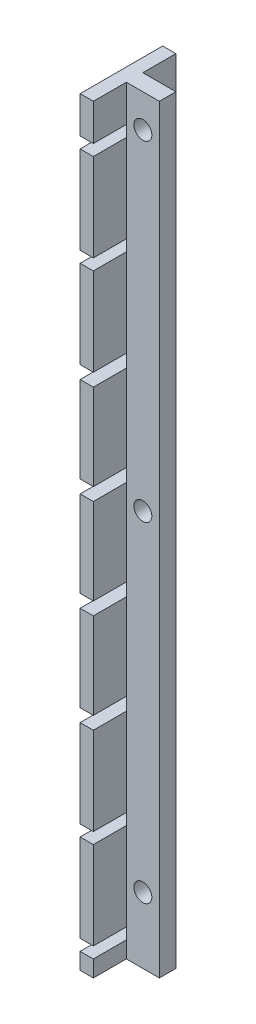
ISO-10303-21;
HEADER;
FILE_DESCRIPTION(('STEP AP214'),'2;1');
FILE_NAME('part.step','',(''),(''),'','','');
FILE_SCHEMA(('AUTOMOTIVE_DESIGN { 1 0 10303 214 1 1 1 1 }'));
ENDSEC;
DATA;
#1=APPLICATION_CONTEXT('core data for automotive mechanical design processes');
#2=APPLICATION_PROTOCOL_DEFINITION('international standard','automotive_design',2000,#1);
#3=PRODUCT_CONTEXT('',#1,'mechanical');
#4=PRODUCT('Part','Part','',(#3));
#5=PRODUCT_RELATED_PRODUCT_CATEGORY('part','',(#4));
#6=PRODUCT_DEFINITION_FORMATION('','',#4);
#7=PRODUCT_DEFINITION_CONTEXT('part definition',#1,'design');
#8=PRODUCT_DEFINITION('design','',#6,#7);
#9=PRODUCT_DEFINITION_SHAPE('','',#8);
#10=(LENGTH_UNIT() NAMED_UNIT(*) SI_UNIT(.MILLI.,.METRE.));
#11=(NAMED_UNIT(*) PLANE_ANGLE_UNIT() SI_UNIT($,.RADIAN.));
#12=(NAMED_UNIT(*) SI_UNIT($,.STERADIAN.) SOLID_ANGLE_UNIT());
#13=UNCERTAINTY_MEASURE_WITH_UNIT(LENGTH_MEASURE(1.E-05),#10,'distance_accuracy_value','');
#14=(GEOMETRIC_REPRESENTATION_CONTEXT(3) GLOBAL_UNCERTAINTY_ASSIGNED_CONTEXT((#13)) GLOBAL_UNIT_ASSIGNED_CONTEXT((#10,
#11,#12)) REPRESENTATION_CONTEXT('',''));
#15=CARTESIAN_POINT('',(0.,0.,0.));
#16=DIRECTION('',(0.,0.,1.));
#17=DIRECTION('',(1.,0.,0.));
#18=AXIS2_PLACEMENT_3D('',#15,#16,#17);
#19=CARTESIAN_POINT('',(-6.34999999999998,-520.7,9.525));
#20=DIRECTION('',(1.,0.,0.));
#21=DIRECTION('',(0.,0.,-1.));
#22=AXIS2_PLACEMENT_3D('',#19,#20,#21);
#23=PLANE('',#22);
#24=DIRECTION('',(0.,0.,1.));
#25=VECTOR('',#24,1.);
#26=CARTESIAN_POINT('',(-6.34999999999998,-381.6985,-9.525));
#27=LINE('',#26,#25);
#28=CARTESIAN_POINT('',(-6.34999999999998,-381.6985,3.175));
#29=VERTEX_POINT('',#28);
#30=CARTESIAN_POINT('',(-6.34999999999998,-381.6985,9.525));
#31=VERTEX_POINT('',#30);
#32=EDGE_CURVE('E851',#29,#31,#27,.T.);
#33=ORIENTED_EDGE('',*,*,#32,.F.);
#34=DIRECTION('',(0.,-1.,0.));
#35=VECTOR('',#34,1.);
#36=CARTESIAN_POINT('',(-6.35,-374.65,3.175));
#37=LINE('',#36,#35);
#38=CARTESIAN_POINT('',(-6.34999999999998,-374.65,3.175));
#39=VERTEX_POINT('',#38);
#40=EDGE_CURVE('E627',#39,#29,#37,.T.);
#41=ORIENTED_EDGE('',*,*,#40,.F.);
#42=DIRECTION('',(0.,0.,-1.));
#43=VECTOR('',#42,1.);
#44=CARTESIAN_POINT('',(-6.34999999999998,-374.65,9.525));
#45=LINE('',#44,#43);
#46=CARTESIAN_POINT('',(-6.34999999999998,-374.65,9.525));
#47=VERTEX_POINT('',#46);
#48=EDGE_CURVE('E439',#47,#39,#45,.T.);
#49=ORIENTED_EDGE('',*,*,#48,.F.);
#50=DIRECTION('',(0.,1.,0.));
#51=VECTOR('',#50,1.);
#52=CARTESIAN_POINT('',(-6.34999999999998,-520.7,9.525));
#53=LINE('',#52,#51);
#54=EDGE_CURVE('E426',#31,#47,#53,.T.);
#55=ORIENTED_EDGE('',*,*,#54,.F.);
#56=EDGE_LOOP('',(#33,#41,#49,#55));
#57=FACE_BOUND('',#56,.T.);
#58=ADVANCED_FACE('F33',(#57),#23,.T.);
#59=CARTESIAN_POINT('',(-6.34999999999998,-381.6985,-6.35));
#60=VERTEX_POINT('',#59);
#61=CARTESIAN_POINT('',(-6.35,-381.6985,0.));
#62=VERTEX_POINT('',#61);
#63=EDGE_CURVE('E51',#60,#62,#27,.T.);
#64=ORIENTED_EDGE('',*,*,#63,.F.);
#65=DIRECTION('',(0.,1.,0.));
#66=VECTOR('',#65,1.);
#67=CARTESIAN_POINT('',(-6.34999999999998,-520.7,-6.35));
#68=LINE('',#67,#66);
#69=CARTESIAN_POINT('',(-6.34999999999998,-374.65,-6.35));
#70=VERTEX_POINT('',#69);
#71=EDGE_CURVE('E438',#60,#70,#68,.T.);
#72=ORIENTED_EDGE('',*,*,#71,.T.);
#73=CARTESIAN_POINT('',(-6.34999999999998,-374.65,0.));
#74=VERTEX_POINT('',#73);
#75=EDGE_CURVE('E444',#74,#70,#45,.T.);
#76=ORIENTED_EDGE('',*,*,#75,.F.);
#77=DIRECTION('',(0.,-1.,0.));
#78=VECTOR('',#77,1.);
#79=CARTESIAN_POINT('',(-6.35,-374.65,0.));
#80=LINE('',#79,#78);
#81=EDGE_CURVE('E653',#74,#62,#80,.T.);
#82=ORIENTED_EDGE('',*,*,#81,.T.);
#83=EDGE_LOOP('',(#64,#72,#76,#82));
#84=FACE_BOUND('',#83,.T.);
#85=ADVANCED_FACE('F862',(#84),#23,.T.);
#86=CARTESIAN_POINT('',(-6.34999999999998,-520.7,9.525));
#87=DIRECTION('',(0.,0.,1.));
#88=DIRECTION('',(1.,0.,0.));
#89=AXIS2_PLACEMENT_3D('',#86,#87,#88);
#90=PLANE('',#89);
#91=DIRECTION('',(-1.,0.,0.));
#92=VECTOR('',#91,1.);
#93=CARTESIAN_POINT('',(-8.89000000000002,-381.6985,9.525));
#94=LINE('',#93,#92);
#95=CARTESIAN_POINT('',(-8.89000000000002,-381.6985,9.525));
#96=VERTEX_POINT('',#95);
#97=EDGE_CURVE('E402',#31,#96,#94,.T.);
#98=ORIENTED_EDGE('',*,*,#97,.F.);
#99=ORIENTED_EDGE('',*,*,#54,.T.);
#100=DIRECTION('',(1.,0.,0.));
#101=VECTOR('',#100,1.);
#102=CARTESIAN_POINT('',(-6.34999999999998,-374.65,9.525));
#103=LINE('',#102,#101);
#104=CARTESIAN_POINT('',(-8.88999999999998,-374.65,9.525));
#105=VERTEX_POINT('',#104);
#106=EDGE_CURVE('E457',#105,#47,#103,.T.);
#107=ORIENTED_EDGE('',*,*,#106,.F.);
#108=DIRECTION('',(0.,1.,0.));
#109=VECTOR('',#108,1.);
#110=CARTESIAN_POINT('',(-8.88999999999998,-520.7,9.525));
#111=LINE('',#110,#109);
#112=EDGE_CURVE('E417',#96,#105,#111,.T.);
#113=ORIENTED_EDGE('',*,*,#112,.F.);
#114=EDGE_LOOP('',(#98,#99,#107,#113));
#115=FACE_BOUND('',#114,.T.);
#116=ADVANCED_FACE('F621',(#115),#90,.T.);
#117=CARTESIAN_POINT('',(-8.88999999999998,-520.7,9.525));
#118=DIRECTION('',(-1.,0.,0.));
#119=DIRECTION('',(0.,0.,1.));
#120=AXIS2_PLACEMENT_3D('',#117,#118,#119);
#121=PLANE('',#120);
#122=DIRECTION('',(0.,0.,1.));
#123=VECTOR('',#122,1.);
#124=CARTESIAN_POINT('',(-8.89000000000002,-381.6985,-9.525));
#125=LINE('',#124,#123);
#126=CARTESIAN_POINT('',(-8.89000000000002,-381.6985,-6.35));
#127=VERTEX_POINT('',#126);
#128=EDGE_CURVE('E846',#127,#96,#125,.T.);
#129=ORIENTED_EDGE('',*,*,#128,.T.);
#130=ORIENTED_EDGE('',*,*,#112,.T.);
#131=DIRECTION('',(0.,0.,1.));
#132=VECTOR('',#131,1.);
#133=CARTESIAN_POINT('',(-8.88999999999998,-374.65,9.525));
#134=LINE('',#133,#132);
#135=CARTESIAN_POINT('',(-8.88999999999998,-374.65,-6.35));
#136=VERTEX_POINT('',#135);
#137=EDGE_CURVE('E454',#136,#105,#134,.T.);
#138=ORIENTED_EDGE('',*,*,#137,.F.);
#139=DIRECTION('',(0.,1.,0.));
#140=VECTOR('',#139,1.);
#141=CARTESIAN_POINT('',(-8.88999999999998,-520.7,-6.35));
#142=LINE('',#141,#140);
#143=EDGE_CURVE('E433',#127,#136,#142,.T.);
#144=ORIENTED_EDGE('',*,*,#143,.F.);
#145=EDGE_LOOP('',(#129,#130,#138,#144));
#146=FACE_BOUND('',#145,.T.);
#147=ADVANCED_FACE('F616',(#146),#121,.T.);
#148=CARTESIAN_POINT('',(-6.34999999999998,-520.7,-6.35));
#149=DIRECTION('',(0.,0.,-1.));
#150=DIRECTION('',(-1.,0.,0.));
#151=AXIS2_PLACEMENT_3D('',#148,#149,#150);
#152=PLANE('',#151);
#153=DIRECTION('',(1.,0.,0.));
#154=VECTOR('',#153,1.);
#155=CARTESIAN_POINT('',(-6.34999999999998,-381.6985,-6.35));
#156=LINE('',#155,#154);
#157=EDGE_CURVE('E612',#127,#60,#156,.T.);
#158=ORIENTED_EDGE('',*,*,#157,.F.);
#159=ORIENTED_EDGE('',*,*,#143,.T.);
#160=DIRECTION('',(-1.,0.,0.));
#161=VECTOR('',#160,1.);
#162=CARTESIAN_POINT('',(-6.34999999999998,-374.65,-6.35));
#163=LINE('',#162,#161);
#164=EDGE_CURVE('E443',#70,#136,#163,.T.);
#165=ORIENTED_EDGE('',*,*,#164,.F.);
#166=ORIENTED_EDGE('',*,*,#71,.F.);
#167=EDGE_LOOP('',(#158,#159,#165,#166));
#168=FACE_BOUND('',#167,.T.);
#169=ADVANCED_FACE('F609',(#168),#152,.T.);
#170=DIRECTION('',(0.,0.,1.));
#171=VECTOR('',#170,1.);
#172=CARTESIAN_POINT('',(-6.34999999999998,-383.8575,-9.525));
#173=LINE('',#172,#171);
#174=CARTESIAN_POINT('',(-6.34999999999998,-383.8575,3.175));
#175=VERTEX_POINT('',#174);
#176=CARTESIAN_POINT('',(-6.34999999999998,-383.8575,9.525));
#177=VERTEX_POINT('',#176);
#178=EDGE_CURVE('E401',#175,#177,#173,.T.);
#179=ORIENTED_EDGE('',*,*,#178,.T.);
#180=CARTESIAN_POINT('',(-6.34999999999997,-400.7485,9.525));
#181=VERTEX_POINT('',#180);
#182=EDGE_CURVE('E411',#181,#177,#53,.T.);
#183=ORIENTED_EDGE('',*,*,#182,.F.);
#184=DIRECTION('',(0.,0.,1.));
#185=VECTOR('',#184,1.);
#186=CARTESIAN_POINT('',(-6.34999999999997,-400.7485,-9.525));
#187=LINE('',#186,#185);
#188=CARTESIAN_POINT('',(-6.34999999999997,-400.7485,3.175));
#189=VERTEX_POINT('',#188);
#190=EDGE_CURVE('E830',#189,#181,#187,.T.);
#191=ORIENTED_EDGE('',*,*,#190,.F.);
#192=EDGE_CURVE('E37',#175,#189,#37,.T.);
#193=ORIENTED_EDGE('',*,*,#192,.F.);
#194=EDGE_LOOP('',(#179,#183,#191,#193));
#195=FACE_BOUND('',#194,.T.);
#196=ADVANCED_FACE('F865',(#195),#23,.T.);
#197=CARTESIAN_POINT('',(-6.34999999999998,-383.8575,-6.35));
#198=VERTEX_POINT('',#197);
#199=CARTESIAN_POINT('',(-6.34999999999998,-383.8575,0.));
#200=VERTEX_POINT('',#199);
#201=EDGE_CURVE('E850',#198,#200,#173,.T.);
#202=ORIENTED_EDGE('',*,*,#201,.T.);
#203=CARTESIAN_POINT('',(-6.34999999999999,-400.7485,0.));
#204=VERTEX_POINT('',#203);
#205=EDGE_CURVE('E59',#200,#204,#80,.T.);
#206=ORIENTED_EDGE('',*,*,#205,.T.);
#207=CARTESIAN_POINT('',(-6.34999999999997,-400.7485,-6.35));
#208=VERTEX_POINT('',#207);
#209=EDGE_CURVE('E832',#208,#204,#187,.T.);
#210=ORIENTED_EDGE('',*,*,#209,.F.);
#211=EDGE_CURVE('E497',#208,#198,#68,.T.);
#212=ORIENTED_EDGE('',*,*,#211,.T.);
#213=EDGE_LOOP('',(#202,#206,#210,#212));
#214=FACE_BOUND('',#213,.T.);
#215=ADVANCED_FACE('F875',(#214),#23,.T.);
#216=DIRECTION('',(1.,0.,0.));
#217=VECTOR('',#216,1.);
#218=CARTESIAN_POINT('',(-8.88999999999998,-383.8575,9.525));
#219=LINE('',#218,#217);
#220=CARTESIAN_POINT('',(-8.88999999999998,-383.8575,9.525));
#221=VERTEX_POINT('',#220);
#222=EDGE_CURVE('E393',#221,#177,#219,.T.);
#223=ORIENTED_EDGE('',*,*,#222,.F.);
#224=CARTESIAN_POINT('',(-8.89000000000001,-400.7485,9.525));
#225=VERTEX_POINT('',#224);
#226=EDGE_CURVE('E409',#225,#221,#111,.T.);
#227=ORIENTED_EDGE('',*,*,#226,.F.);
#228=DIRECTION('',(-1.,0.,0.));
#229=VECTOR('',#228,1.);
#230=CARTESIAN_POINT('',(-8.89000000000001,-400.7485,9.525));
#231=LINE('',#230,#229);
#232=EDGE_CURVE('E827',#181,#225,#231,.T.);
#233=ORIENTED_EDGE('',*,*,#232,.F.);
#234=ORIENTED_EDGE('',*,*,#182,.T.);
#235=EDGE_LOOP('',(#223,#227,#233,#234));
#236=FACE_BOUND('',#235,.T.);
#237=ADVANCED_FACE('F407',(#236),#90,.T.);
#238=DIRECTION('',(0.,0.,1.));
#239=VECTOR('',#238,1.);
#240=CARTESIAN_POINT('',(-8.88999999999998,-383.8575,-9.525));
#241=LINE('',#240,#239);
#242=CARTESIAN_POINT('',(-8.88999999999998,-383.8575,-6.35));
#243=VERTEX_POINT('',#242);
#244=EDGE_CURVE('E390',#243,#221,#241,.T.);
#245=ORIENTED_EDGE('',*,*,#244,.F.);
#246=CARTESIAN_POINT('',(-8.89000000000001,-400.7485,-6.35));
#247=VERTEX_POINT('',#246);
#248=EDGE_CURVE('E615',#247,#243,#142,.T.);
#249=ORIENTED_EDGE('',*,*,#248,.F.);
#250=DIRECTION('',(0.,0.,1.));
#251=VECTOR('',#250,1.);
#252=CARTESIAN_POINT('',(-8.89000000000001,-400.7485,-9.525));
#253=LINE('',#252,#251);
#254=EDGE_CURVE('E415',#247,#225,#253,.T.);
#255=ORIENTED_EDGE('',*,*,#254,.T.);
#256=ORIENTED_EDGE('',*,*,#226,.T.);
#257=EDGE_LOOP('',(#245,#249,#255,#256));
#258=FACE_BOUND('',#257,.T.);
#259=ADVANCED_FACE('F414',(#258),#121,.T.);
#260=DIRECTION('',(-1.,0.,0.));
#261=VECTOR('',#260,1.);
#262=CARTESIAN_POINT('',(-6.34999999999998,-383.8575,-6.35));
#263=LINE('',#262,#261);
#264=EDGE_CURVE('E396',#198,#243,#263,.T.);
#265=ORIENTED_EDGE('',*,*,#264,.F.);
#266=ORIENTED_EDGE('',*,*,#211,.F.);
#267=DIRECTION('',(1.,0.,0.));
#268=VECTOR('',#267,1.);
#269=CARTESIAN_POINT('',(-6.34999999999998,-400.7485,-6.35));
#270=LINE('',#269,#268);
#271=EDGE_CURVE('E885',#247,#208,#270,.T.);
#272=ORIENTED_EDGE('',*,*,#271,.F.);
#273=ORIENTED_EDGE('',*,*,#248,.T.);
#274=EDGE_LOOP('',(#265,#266,#272,#273));
#275=FACE_BOUND('',#274,.T.);
#276=ADVANCED_FACE('F881',(#275),#152,.T.);
#277=DIRECTION('',(0.,0.,1.));
#278=VECTOR('',#277,1.);
#279=CARTESIAN_POINT('',(-6.34999999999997,-402.9075,-9.525));
#280=LINE('',#279,#278);
#281=CARTESIAN_POINT('',(-6.34999999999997,-402.9075,3.175));
#282=VERTEX_POINT('',#281);
#283=CARTESIAN_POINT('',(-6.34999999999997,-402.9075,9.525));
#284=VERTEX_POINT('',#283);
#285=EDGE_CURVE('E820',#282,#284,#280,.T.);
#286=ORIENTED_EDGE('',*,*,#285,.T.);
#287=CARTESIAN_POINT('',(-6.34999999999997,-419.7985,9.525));
#288=VERTEX_POINT('',#287);
#289=EDGE_CURVE('E800',#288,#284,#53,.T.);
#290=ORIENTED_EDGE('',*,*,#289,.F.);
#291=DIRECTION('',(0.,0.,1.));
#292=VECTOR('',#291,1.);
#293=CARTESIAN_POINT('',(-6.34999999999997,-419.7985,-9.525));
#294=LINE('',#293,#292);
#295=CARTESIAN_POINT('',(-6.34999999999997,-419.7985,3.175));
#296=VERTEX_POINT('',#295);
#297=EDGE_CURVE('E819',#296,#288,#294,.T.);
#298=ORIENTED_EDGE('',*,*,#297,.F.);
#299=EDGE_CURVE('E713',#282,#296,#37,.T.);
#300=ORIENTED_EDGE('',*,*,#299,.F.);
#301=EDGE_LOOP('',(#286,#290,#298,#300));
#302=FACE_BOUND('',#301,.T.);
#303=ADVANCED_FACE('F817',(#302),#23,.T.);
#304=CARTESIAN_POINT('',(-6.34999999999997,-402.9075,-6.35));
#305=VERTEX_POINT('',#304);
#306=CARTESIAN_POINT('',(-6.34999999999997,-402.9075,0.));
#307=VERTEX_POINT('',#306);
#308=EDGE_CURVE('E826',#305,#307,#280,.T.);
#309=ORIENTED_EDGE('',*,*,#308,.T.);
#310=CARTESIAN_POINT('',(-6.34999999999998,-419.7985,0.));
#311=VERTEX_POINT('',#310);
#312=EDGE_CURVE('E710',#307,#311,#80,.T.);
#313=ORIENTED_EDGE('',*,*,#312,.T.);
#314=CARTESIAN_POINT('',(-6.34999999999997,-419.7985,-6.35));
#315=VERTEX_POINT('',#314);
#316=EDGE_CURVE('E1013',#315,#311,#294,.T.);
#317=ORIENTED_EDGE('',*,*,#316,.F.);
#318=EDGE_CURVE('E502',#315,#305,#68,.T.);
#319=ORIENTED_EDGE('',*,*,#318,.T.);
#320=EDGE_LOOP('',(#309,#313,#317,#319));
#321=FACE_BOUND('',#320,.T.);
#322=ADVANCED_FACE('F1254',(#321),#23,.T.);
#323=DIRECTION('',(1.,0.,0.));
#324=VECTOR('',#323,1.);
#325=CARTESIAN_POINT('',(-8.88999999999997,-402.9075,9.525));
#326=LINE('',#325,#324);
#327=CARTESIAN_POINT('',(-8.88999999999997,-402.9075,9.525));
#328=VERTEX_POINT('',#327);
#329=EDGE_CURVE('E812',#328,#284,#326,.T.);
#330=ORIENTED_EDGE('',*,*,#329,.F.);
#331=CARTESIAN_POINT('',(-8.89,-419.7985,9.525));
#332=VERTEX_POINT('',#331);
#333=EDGE_CURVE('E416',#332,#328,#111,.T.);
#334=ORIENTED_EDGE('',*,*,#333,.F.);
#335=DIRECTION('',(-1.,0.,0.));
#336=VECTOR('',#335,1.);
#337=CARTESIAN_POINT('',(-8.89,-419.7985,9.525));
#338=LINE('',#337,#336);
#339=EDGE_CURVE('E813',#288,#332,#338,.T.);
#340=ORIENTED_EDGE('',*,*,#339,.F.);
#341=ORIENTED_EDGE('',*,*,#289,.T.);
#342=EDGE_LOOP('',(#330,#334,#340,#341));
#343=FACE_BOUND('',#342,.T.);
#344=ADVANCED_FACE('F810',(#343),#90,.T.);
#345=DIRECTION('',(0.,0.,1.));
#346=VECTOR('',#345,1.);
#347=CARTESIAN_POINT('',(-8.88999999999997,-402.9075,-9.525));
#348=LINE('',#347,#346);
#349=CARTESIAN_POINT('',(-8.88999999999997,-402.9075,-6.35));
#350=VERTEX_POINT('',#349);
#351=EDGE_CURVE('E824',#350,#328,#348,.T.);
#352=ORIENTED_EDGE('',*,*,#351,.F.);
#353=CARTESIAN_POINT('',(-8.89,-419.7985,-6.35));
#354=VERTEX_POINT('',#353);
#355=EDGE_CURVE('E886',#354,#350,#142,.T.);
#356=ORIENTED_EDGE('',*,*,#355,.F.);
#357=DIRECTION('',(0.,0.,1.));
#358=VECTOR('',#357,1.);
#359=CARTESIAN_POINT('',(-8.89,-419.7985,-9.525));
#360=LINE('',#359,#358);
#361=EDGE_CURVE('E1009',#354,#332,#360,.T.);
#362=ORIENTED_EDGE('',*,*,#361,.T.);
#363=ORIENTED_EDGE('',*,*,#333,.T.);
#364=EDGE_LOOP('',(#352,#356,#362,#363));
#365=FACE_BOUND('',#364,.T.);
#366=ADVANCED_FACE('F1241',(#365),#121,.T.);
#367=DIRECTION('',(-1.,0.,0.));
#368=VECTOR('',#367,1.);
#369=CARTESIAN_POINT('',(-6.34999999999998,-402.9075,-6.35));
#370=LINE('',#369,#368);
#371=EDGE_CURVE('E837',#305,#350,#370,.T.);
#372=ORIENTED_EDGE('',*,*,#371,.F.);
#373=ORIENTED_EDGE('',*,*,#318,.F.);
#374=DIRECTION('',(1.,0.,0.));
#375=VECTOR('',#374,1.);
#376=CARTESIAN_POINT('',(-6.34999999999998,-419.7985,-6.35));
#377=LINE('',#376,#375);
#378=EDGE_CURVE('E1020',#354,#315,#377,.T.);
#379=ORIENTED_EDGE('',*,*,#378,.F.);
#380=ORIENTED_EDGE('',*,*,#355,.T.);
#381=EDGE_LOOP('',(#372,#373,#379,#380));
#382=FACE_BOUND('',#381,.T.);
#383=ADVANCED_FACE('F1247',(#382),#152,.T.);
#384=DIRECTION('',(0.,0.,1.));
#385=VECTOR('',#384,1.);
#386=CARTESIAN_POINT('',(-6.35,-422.275,-9.525));
#387=LINE('',#386,#385);
#388=CARTESIAN_POINT('',(-6.35,-422.275,3.175));
#389=VERTEX_POINT('',#388);
#390=CARTESIAN_POINT('',(-6.35,-422.275,9.525));
#391=VERTEX_POINT('',#390);
#392=EDGE_CURVE('E1000',#389,#391,#387,.T.);
#393=ORIENTED_EDGE('',*,*,#392,.T.);
#394=CARTESIAN_POINT('',(-6.34999999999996,-438.8485,9.525));
#395=VERTEX_POINT('',#394);
#396=EDGE_CURVE('E794',#395,#391,#53,.T.);
#397=ORIENTED_EDGE('',*,*,#396,.F.);
#398=DIRECTION('',(0.,0.,1.));
#399=VECTOR('',#398,1.);
#400=CARTESIAN_POINT('',(-6.34999999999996,-438.8485,-9.525));
#401=LINE('',#400,#399);
#402=CARTESIAN_POINT('',(-6.34999999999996,-438.8485,3.175));
#403=VERTEX_POINT('',#402);
#404=EDGE_CURVE('E1032',#403,#395,#401,.T.);
#405=ORIENTED_EDGE('',*,*,#404,.F.);
#406=EDGE_CURVE('E1054',#389,#403,#37,.T.);
#407=ORIENTED_EDGE('',*,*,#406,.F.);
#408=EDGE_LOOP('',(#393,#397,#405,#407));
#409=FACE_BOUND('',#408,.T.);
#410=ADVANCED_FACE('F1055',(#409),#23,.T.);
#411=CARTESIAN_POINT('',(-6.35,-422.275,-6.35));
#412=VERTEX_POINT('',#411);
#413=CARTESIAN_POINT('',(-6.35,-422.275,0.));
#414=VERTEX_POINT('',#413);
#415=EDGE_CURVE('E1006',#412,#414,#387,.T.);
#416=ORIENTED_EDGE('',*,*,#415,.T.);
#417=CARTESIAN_POINT('',(-6.34999999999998,-438.8485,0.));
#418=VERTEX_POINT('',#417);
#419=EDGE_CURVE('E704',#414,#418,#80,.T.);
#420=ORIENTED_EDGE('',*,*,#419,.T.);
#421=CARTESIAN_POINT('',(-6.34999999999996,-438.8485,-6.35));
#422=VERTEX_POINT('',#421);
#423=EDGE_CURVE('E1035',#422,#418,#401,.T.);
#424=ORIENTED_EDGE('',*,*,#423,.F.);
#425=EDGE_CURVE('E505',#422,#412,#68,.T.);
#426=ORIENTED_EDGE('',*,*,#425,.T.);
#427=EDGE_LOOP('',(#416,#420,#424,#426));
#428=FACE_BOUND('',#427,.T.);
#429=ADVANCED_FACE('F1045',(#428),#23,.T.);
#430=DIRECTION('',(1.,0.,0.));
#431=VECTOR('',#430,1.);
#432=CARTESIAN_POINT('',(-8.88999999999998,-422.275,9.525));
#433=LINE('',#432,#431);
#434=CARTESIAN_POINT('',(-8.88999999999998,-422.275,9.525));
#435=VERTEX_POINT('',#434);
#436=EDGE_CURVE('E996',#435,#391,#433,.T.);
#437=ORIENTED_EDGE('',*,*,#436,.F.);
#438=CARTESIAN_POINT('',(-8.89,-438.8485,9.525));
#439=VERTEX_POINT('',#438);
#440=EDGE_CURVE('E420',#439,#435,#111,.T.);
#441=ORIENTED_EDGE('',*,*,#440,.F.);
#442=DIRECTION('',(-1.,0.,0.));
#443=VECTOR('',#442,1.);
#444=CARTESIAN_POINT('',(-8.89,-438.8485,9.525));
#445=LINE('',#444,#443);
#446=EDGE_CURVE('E995',#395,#439,#445,.T.);
#447=ORIENTED_EDGE('',*,*,#446,.F.);
#448=ORIENTED_EDGE('',*,*,#396,.T.);
#449=EDGE_LOOP('',(#437,#441,#447,#448));
#450=FACE_BOUND('',#449,.T.);
#451=ADVANCED_FACE('F994',(#450),#90,.T.);
#452=DIRECTION('',(0.,0.,1.));
#453=VECTOR('',#452,1.);
#454=CARTESIAN_POINT('',(-8.88999999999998,-422.275,-9.525));
#455=LINE('',#454,#453);
#456=CARTESIAN_POINT('',(-8.88999999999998,-422.275,-6.35));
#457=VERTEX_POINT('',#456);
#458=EDGE_CURVE('E992',#457,#435,#455,.T.);
#459=ORIENTED_EDGE('',*,*,#458,.F.);
#460=CARTESIAN_POINT('',(-8.89,-438.8485,-6.35));
#461=VERTEX_POINT('',#460);
#462=EDGE_CURVE('E888',#461,#457,#142,.T.);
#463=ORIENTED_EDGE('',*,*,#462,.F.);
#464=DIRECTION('',(0.,0.,1.));
#465=VECTOR('',#464,1.);
#466=CARTESIAN_POINT('',(-8.89,-438.8485,-9.525));
#467=LINE('',#466,#465);
#468=EDGE_CURVE('E993',#461,#439,#467,.T.);
#469=ORIENTED_EDGE('',*,*,#468,.T.);
#470=ORIENTED_EDGE('',*,*,#440,.T.);
#471=EDGE_LOOP('',(#459,#463,#469,#470));
#472=FACE_BOUND('',#471,.T.);
#473=ADVANCED_FACE('F991',(#472),#121,.T.);
#474=DIRECTION('',(-1.,0.,0.));
#475=VECTOR('',#474,1.);
#476=CARTESIAN_POINT('',(-6.34999999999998,-422.275,-6.35));
#477=LINE('',#476,#475);
#478=EDGE_CURVE('E1012',#412,#457,#477,.T.);
#479=ORIENTED_EDGE('',*,*,#478,.F.);
#480=ORIENTED_EDGE('',*,*,#425,.F.);
#481=DIRECTION('',(1.,0.,0.));
#482=VECTOR('',#481,1.);
#483=CARTESIAN_POINT('',(-6.34999999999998,-438.8485,-6.35));
#484=LINE('',#483,#482);
#485=EDGE_CURVE('E930',#461,#422,#484,.T.);
#486=ORIENTED_EDGE('',*,*,#485,.F.);
#487=ORIENTED_EDGE('',*,*,#462,.T.);
#488=EDGE_LOOP('',(#479,#480,#486,#487));
#489=FACE_BOUND('',#488,.T.);
#490=ADVANCED_FACE('F1046',(#489),#152,.T.);
#491=DIRECTION('',(0.,0.,1.));
#492=VECTOR('',#491,1.);
#493=CARTESIAN_POINT('',(-6.35,-441.325,-9.525));
#494=LINE('',#493,#492);
#495=CARTESIAN_POINT('',(-6.35,-441.325,3.175));
#496=VERTEX_POINT('',#495);
#497=CARTESIAN_POINT('',(-6.35,-441.325,9.525));
#498=VERTEX_POINT('',#497);
#499=EDGE_CURVE('E1025',#496,#498,#494,.T.);
#500=ORIENTED_EDGE('',*,*,#499,.T.);
#501=CARTESIAN_POINT('',(-6.34999999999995,-457.8985,9.525));
#502=VERTEX_POINT('',#501);
#503=EDGE_CURVE('E787',#502,#498,#53,.T.);
#504=ORIENTED_EDGE('',*,*,#503,.F.);
#505=DIRECTION('',(0.,0.,1.));
#506=VECTOR('',#505,1.);
#507=CARTESIAN_POINT('',(-6.34999999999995,-457.8985,-9.525));
#508=LINE('',#507,#506);
#509=CARTESIAN_POINT('',(-6.34999999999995,-457.8985,3.175));
#510=VERTEX_POINT('',#509);
#511=EDGE_CURVE('E945',#510,#502,#508,.T.);
#512=ORIENTED_EDGE('',*,*,#511,.F.);
#513=EDGE_CURVE('E1057',#496,#510,#37,.T.);
#514=ORIENTED_EDGE('',*,*,#513,.F.);
#515=EDGE_LOOP('',(#500,#504,#512,#514));
#516=FACE_BOUND('',#515,.T.);
#517=ADVANCED_FACE('F1246',(#516),#23,.T.);
#518=CARTESIAN_POINT('',(-6.35,-441.325,-6.35));
#519=VERTEX_POINT('',#518);
#520=CARTESIAN_POINT('',(-6.35,-441.325,0.));
#521=VERTEX_POINT('',#520);
#522=EDGE_CURVE('E1029',#519,#521,#494,.T.);
#523=ORIENTED_EDGE('',*,*,#522,.T.);
#524=CARTESIAN_POINT('',(-6.34999999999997,-457.8985,0.));
#525=VERTEX_POINT('',#524);
#526=EDGE_CURVE('E697',#521,#525,#80,.T.);
#527=ORIENTED_EDGE('',*,*,#526,.T.);
#528=CARTESIAN_POINT('',(-6.34999999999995,-457.8985,-6.35));
#529=VERTEX_POINT('',#528);
#530=EDGE_CURVE('E950',#529,#525,#508,.T.);
#531=ORIENTED_EDGE('',*,*,#530,.F.);
#532=EDGE_CURVE('E511',#529,#519,#68,.T.);
#533=ORIENTED_EDGE('',*,*,#532,.T.);
#534=EDGE_LOOP('',(#523,#527,#531,#533));
#535=FACE_BOUND('',#534,.T.);
#536=ADVANCED_FACE('F1239',(#535),#23,.T.);
#537=DIRECTION('',(1.,0.,0.));
#538=VECTOR('',#537,1.);
#539=CARTESIAN_POINT('',(-8.88999999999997,-441.325,9.525));
#540=LINE('',#539,#538);
#541=CARTESIAN_POINT('',(-8.88999999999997,-441.325,9.525));
#542=VERTEX_POINT('',#541);
#543=EDGE_CURVE('E1022',#542,#498,#540,.T.);
#544=ORIENTED_EDGE('',*,*,#543,.F.);
#545=CARTESIAN_POINT('',(-8.88999999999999,-457.8985,9.525));
#546=VERTEX_POINT('',#545);
#547=EDGE_CURVE('E977',#546,#542,#111,.T.);
#548=ORIENTED_EDGE('',*,*,#547,.F.);
#549=DIRECTION('',(-1.,0.,0.));
#550=VECTOR('',#549,1.);
#551=CARTESIAN_POINT('',(-8.88999999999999,-457.8985,9.525));
#552=LINE('',#551,#550);
#553=EDGE_CURVE('E943',#502,#546,#552,.T.);
#554=ORIENTED_EDGE('',*,*,#553,.F.);
#555=ORIENTED_EDGE('',*,*,#503,.T.);
#556=EDGE_LOOP('',(#544,#548,#554,#555));
#557=FACE_BOUND('',#556,.T.);
#558=ADVANCED_FACE('F1233',(#557),#90,.T.);
#559=DIRECTION('',(0.,0.,1.));
#560=VECTOR('',#559,1.);
#561=CARTESIAN_POINT('',(-8.88999999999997,-441.325,-9.525));
#562=LINE('',#561,#560);
#563=CARTESIAN_POINT('',(-8.88999999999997,-441.325,-6.35));
#564=VERTEX_POINT('',#563);
#565=EDGE_CURVE('E1024',#564,#542,#562,.T.);
#566=ORIENTED_EDGE('',*,*,#565,.F.);
#567=CARTESIAN_POINT('',(-8.88999999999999,-457.8985,-6.35));
#568=VERTEX_POINT('',#567);
#569=EDGE_CURVE('E894',#568,#564,#142,.T.);
#570=ORIENTED_EDGE('',*,*,#569,.F.);
#571=DIRECTION('',(0.,0.,1.));
#572=VECTOR('',#571,1.);
#573=CARTESIAN_POINT('',(-8.88999999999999,-457.8985,-9.525));
#574=LINE('',#573,#572);
#575=EDGE_CURVE('E946',#568,#546,#574,.T.);
#576=ORIENTED_EDGE('',*,*,#575,.T.);
#577=ORIENTED_EDGE('',*,*,#547,.T.);
#578=EDGE_LOOP('',(#566,#570,#576,#577));
#579=FACE_BOUND('',#578,.T.);
#580=ADVANCED_FACE('F1227',(#579),#121,.T.);
#581=DIRECTION('',(-1.,0.,0.));
#582=VECTOR('',#581,1.);
#583=CARTESIAN_POINT('',(-6.34999999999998,-441.325,-6.35));
#584=LINE('',#583,#582);
#585=EDGE_CURVE('E1034',#519,#564,#584,.T.);
#586=ORIENTED_EDGE('',*,*,#585,.F.);
#587=ORIENTED_EDGE('',*,*,#532,.F.);
#588=DIRECTION('',(1.,0.,0.));
#589=VECTOR('',#588,1.);
#590=CARTESIAN_POINT('',(-6.34999999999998,-457.8985,-6.35));
#591=LINE('',#590,#589);
#592=EDGE_CURVE('E957',#568,#529,#591,.T.);
#593=ORIENTED_EDGE('',*,*,#592,.F.);
#594=ORIENTED_EDGE('',*,*,#569,.T.);
#595=EDGE_LOOP('',(#586,#587,#593,#594));
#596=FACE_BOUND('',#595,.T.);
#597=ADVANCED_FACE('F1232',(#596),#152,.T.);
#598=DIRECTION('',(0.,0.,1.));
#599=VECTOR('',#598,1.);
#600=CARTESIAN_POINT('',(-6.34999999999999,-479.425,-9.525));
#601=LINE('',#600,#599);
#602=CARTESIAN_POINT('',(-6.34999999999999,-479.425,3.175));
#603=VERTEX_POINT('',#602);
#604=CARTESIAN_POINT('',(-6.34999999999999,-479.425,9.525));
#605=VERTEX_POINT('',#604);
#606=EDGE_CURVE('E923',#603,#605,#601,.T.);
#607=ORIENTED_EDGE('',*,*,#606,.T.);
#608=CARTESIAN_POINT('',(-6.34999999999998,-496.316,9.525));
#609=VERTEX_POINT('',#608);
#610=EDGE_CURVE('E780',#609,#605,#53,.T.);
#611=ORIENTED_EDGE('',*,*,#610,.F.);
#612=DIRECTION('',(0.,0.,1.));
#613=VECTOR('',#612,1.);
#614=CARTESIAN_POINT('',(-6.34999999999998,-496.316,-9.525));
#615=LINE('',#614,#613);
#616=CARTESIAN_POINT('',(-6.34999999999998,-496.316,3.175));
#617=VERTEX_POINT('',#616);
#618=EDGE_CURVE('E963',#617,#609,#615,.T.);
#619=ORIENTED_EDGE('',*,*,#618,.F.);
#620=EDGE_CURVE('E1076',#603,#617,#37,.T.);
#621=ORIENTED_EDGE('',*,*,#620,.F.);
#622=EDGE_LOOP('',(#607,#611,#619,#621));
#623=FACE_BOUND('',#622,.T.);
#624=ADVANCED_FACE('F1167',(#623),#23,.T.);
#625=CARTESIAN_POINT('',(-6.34999999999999,-479.425,-6.35));
#626=VERTEX_POINT('',#625);
#627=CARTESIAN_POINT('',(-6.34999999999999,-479.425,0.));
#628=VERTEX_POINT('',#627);
#629=EDGE_CURVE('E929',#626,#628,#601,.T.);
#630=ORIENTED_EDGE('',*,*,#629,.T.);
#631=CARTESIAN_POINT('',(-6.34999999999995,-496.316,0.));
#632=VERTEX_POINT('',#631);
#633=EDGE_CURVE('E690',#628,#632,#80,.T.);
#634=ORIENTED_EDGE('',*,*,#633,.T.);
#635=CARTESIAN_POINT('',(-6.34999999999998,-496.316,-6.35));
#636=VERTEX_POINT('',#635);
#637=EDGE_CURVE('E555',#636,#632,#615,.T.);
#638=ORIENTED_EDGE('',*,*,#637,.F.);
#639=EDGE_CURVE('E518',#636,#626,#68,.T.);
#640=ORIENTED_EDGE('',*,*,#639,.T.);
#641=EDGE_LOOP('',(#630,#634,#638,#640));
#642=FACE_BOUND('',#641,.T.);
#643=ADVANCED_FACE('F1152',(#642),#23,.T.);
#644=DIRECTION('',(1.,0.,0.));
#645=VECTOR('',#644,1.);
#646=CARTESIAN_POINT('',(-8.88999999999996,-479.425,9.525));
#647=LINE('',#646,#645);
#648=CARTESIAN_POINT('',(-8.88999999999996,-479.425,9.525));
#649=VERTEX_POINT('',#648);
#650=EDGE_CURVE('E924',#649,#605,#647,.T.);
#651=ORIENTED_EDGE('',*,*,#650,.F.);
#652=CARTESIAN_POINT('',(-8.88999999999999,-496.316,9.525));
#653=VERTEX_POINT('',#652);
#654=EDGE_CURVE('E920',#653,#649,#111,.T.);
#655=ORIENTED_EDGE('',*,*,#654,.F.);
#656=DIRECTION('',(-1.,0.,0.));
#657=VECTOR('',#656,1.);
#658=CARTESIAN_POINT('',(-8.88999999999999,-496.316,9.525));
#659=LINE('',#658,#657);
#660=EDGE_CURVE('E961',#609,#653,#659,.T.);
#661=ORIENTED_EDGE('',*,*,#660,.F.);
#662=ORIENTED_EDGE('',*,*,#610,.T.);
#663=EDGE_LOOP('',(#651,#655,#661,#662));
#664=FACE_BOUND('',#663,.T.);
#665=ADVANCED_FACE('F1150',(#664),#90,.T.);
#666=DIRECTION('',(0.,0.,1.));
#667=VECTOR('',#666,1.);
#668=CARTESIAN_POINT('',(-8.88999999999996,-479.425,-9.525));
#669=LINE('',#668,#667);
#670=CARTESIAN_POINT('',(-8.88999999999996,-479.425,-6.35));
#671=VERTEX_POINT('',#670);
#672=EDGE_CURVE('E919',#671,#649,#669,.T.);
#673=ORIENTED_EDGE('',*,*,#672,.F.);
#674=CARTESIAN_POINT('',(-8.88999999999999,-496.316,-6.35));
#675=VERTEX_POINT('',#674);
#676=EDGE_CURVE('E901',#675,#671,#142,.T.);
#677=ORIENTED_EDGE('',*,*,#676,.F.);
#678=DIRECTION('',(0.,0.,1.));
#679=VECTOR('',#678,1.);
#680=CARTESIAN_POINT('',(-8.88999999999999,-496.316,-9.525));
#681=LINE('',#680,#679);
#682=EDGE_CURVE('E549',#675,#653,#681,.T.);
#683=ORIENTED_EDGE('',*,*,#682,.T.);
#684=ORIENTED_EDGE('',*,*,#654,.T.);
#685=EDGE_LOOP('',(#673,#677,#683,#684));
#686=FACE_BOUND('',#685,.T.);
#687=ADVANCED_FACE('F916',(#686),#121,.T.);
#688=DIRECTION('',(-1.,0.,0.));
#689=VECTOR('',#688,1.);
#690=CARTESIAN_POINT('',(-6.34999999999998,-479.425,-6.35));
#691=LINE('',#690,#689);
#692=EDGE_CURVE('E913',#626,#671,#691,.T.);
#693=ORIENTED_EDGE('',*,*,#692,.F.);
#694=ORIENTED_EDGE('',*,*,#639,.F.);
#695=DIRECTION('',(1.,0.,0.));
#696=VECTOR('',#695,1.);
#697=CARTESIAN_POINT('',(-6.34999999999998,-496.316,-6.35));
#698=LINE('',#697,#696);
#699=EDGE_CURVE('E552',#675,#636,#698,.T.);
#700=ORIENTED_EDGE('',*,*,#699,.F.);
#701=ORIENTED_EDGE('',*,*,#676,.T.);
#702=EDGE_LOOP('',(#693,#694,#700,#701));
#703=FACE_BOUND('',#702,.T.);
#704=ADVANCED_FACE('F912',(#703),#152,.T.);
#705=DIRECTION('',(0.,0.,1.));
#706=VECTOR('',#705,1.);
#707=CARTESIAN_POINT('',(-6.34999999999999,-460.375,-9.525));
#708=LINE('',#707,#706);
#709=CARTESIAN_POINT('',(-6.34999999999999,-460.375,3.175));
#710=VERTEX_POINT('',#709);
#711=CARTESIAN_POINT('',(-6.34999999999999,-460.375,9.525));
#712=VERTEX_POINT('',#711);
#713=EDGE_CURVE('E937',#710,#712,#708,.T.);
#714=ORIENTED_EDGE('',*,*,#713,.T.);
#715=CARTESIAN_POINT('',(-6.34999999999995,-476.9485,9.525));
#716=VERTEX_POINT('',#715);
#717=EDGE_CURVE('E781',#716,#712,#53,.T.);
#718=ORIENTED_EDGE('',*,*,#717,.F.);
#719=DIRECTION('',(0.,0.,1.));
#720=VECTOR('',#719,1.);
#721=CARTESIAN_POINT('',(-6.34999999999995,-476.9485,-9.525));
#722=LINE('',#721,#720);
#723=CARTESIAN_POINT('',(-6.34999999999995,-476.9485,3.175));
#724=VERTEX_POINT('',#723);
#725=EDGE_CURVE('E564',#724,#716,#722,.T.);
#726=ORIENTED_EDGE('',*,*,#725,.F.);
#727=EDGE_CURVE('E1074',#710,#724,#37,.T.);
#728=ORIENTED_EDGE('',*,*,#727,.F.);
#729=EDGE_LOOP('',(#714,#718,#726,#728));
#730=FACE_BOUND('',#729,.T.);
#731=ADVANCED_FACE('F1145',(#730),#23,.T.);
#732=CARTESIAN_POINT('',(-6.34999999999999,-460.375,-6.35));
#733=VERTEX_POINT('',#732);
#734=CARTESIAN_POINT('',(-6.34999999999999,-460.375,0.));
#735=VERTEX_POINT('',#734);
#736=EDGE_CURVE('E941',#733,#735,#708,.T.);
#737=ORIENTED_EDGE('',*,*,#736,.T.);
#738=CARTESIAN_POINT('',(-6.34999999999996,-476.9485,0.));
#739=VERTEX_POINT('',#738);
#740=EDGE_CURVE('E686',#735,#739,#80,.T.);
#741=ORIENTED_EDGE('',*,*,#740,.T.);
#742=CARTESIAN_POINT('',(-6.34999999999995,-476.9485,-6.35));
#743=VERTEX_POINT('',#742);
#744=EDGE_CURVE('E569',#743,#739,#722,.T.);
#745=ORIENTED_EDGE('',*,*,#744,.F.);
#746=EDGE_CURVE('E517',#743,#733,#68,.T.);
#747=ORIENTED_EDGE('',*,*,#746,.T.);
#748=EDGE_LOOP('',(#737,#741,#745,#747));
#749=FACE_BOUND('',#748,.T.);
#750=ADVANCED_FACE('F1138',(#749),#23,.T.);
#751=DIRECTION('',(1.,0.,0.));
#752=VECTOR('',#751,1.);
#753=CARTESIAN_POINT('',(-8.88999999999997,-460.375,9.525));
#754=LINE('',#753,#752);
#755=CARTESIAN_POINT('',(-8.88999999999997,-460.375,9.525));
#756=VERTEX_POINT('',#755);
#757=EDGE_CURVE('E934',#756,#712,#754,.T.);
#758=ORIENTED_EDGE('',*,*,#757,.F.);
#759=CARTESIAN_POINT('',(-8.88999999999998,-476.9485,9.525));
#760=VERTEX_POINT('',#759);
#761=EDGE_CURVE('E976',#760,#756,#111,.T.);
#762=ORIENTED_EDGE('',*,*,#761,.F.);
#763=DIRECTION('',(-1.,0.,0.));
#764=VECTOR('',#763,1.);
#765=CARTESIAN_POINT('',(-8.88999999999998,-476.9485,9.525));
#766=LINE('',#765,#764);
#767=EDGE_CURVE('E562',#716,#760,#766,.T.);
#768=ORIENTED_EDGE('',*,*,#767,.F.);
#769=ORIENTED_EDGE('',*,*,#717,.T.);
#770=EDGE_LOOP('',(#758,#762,#768,#769));
#771=FACE_BOUND('',#770,.T.);
#772=ADVANCED_FACE('F1136',(#771),#90,.T.);
#773=DIRECTION('',(0.,0.,1.));
#774=VECTOR('',#773,1.);
#775=CARTESIAN_POINT('',(-8.88999999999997,-460.375,-9.525));
#776=LINE('',#775,#774);
#777=CARTESIAN_POINT('',(-8.88999999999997,-460.375,-6.35));
#778=VERTEX_POINT('',#777);
#779=EDGE_CURVE('E936',#778,#756,#776,.T.);
#780=ORIENTED_EDGE('',*,*,#779,.F.);
#781=CARTESIAN_POINT('',(-8.88999999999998,-476.9485,-6.35));
#782=VERTEX_POINT('',#781);
#783=EDGE_CURVE('E900',#782,#778,#142,.T.);
#784=ORIENTED_EDGE('',*,*,#783,.F.);
#785=DIRECTION('',(0.,0.,1.));
#786=VECTOR('',#785,1.);
#787=CARTESIAN_POINT('',(-8.88999999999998,-476.9485,-9.525));
#788=LINE('',#787,#786);
#789=EDGE_CURVE('E565',#782,#760,#788,.T.);
#790=ORIENTED_EDGE('',*,*,#789,.T.);
#791=ORIENTED_EDGE('',*,*,#761,.T.);
#792=EDGE_LOOP('',(#780,#784,#790,#791));
#793=FACE_BOUND('',#792,.T.);
#794=ADVANCED_FACE('F1142',(#793),#121,.T.);
#795=DIRECTION('',(-1.,0.,0.));
#796=VECTOR('',#795,1.);
#797=CARTESIAN_POINT('',(-6.34999999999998,-460.375,-6.35));
#798=LINE('',#797,#796);
#799=EDGE_CURVE('E949',#733,#778,#798,.T.);
#800=ORIENTED_EDGE('',*,*,#799,.F.);
#801=ORIENTED_EDGE('',*,*,#746,.F.);
#802=DIRECTION('',(1.,0.,0.));
#803=VECTOR('',#802,1.);
#804=CARTESIAN_POINT('',(-6.34999999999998,-476.9485,-6.35));
#805=LINE('',#804,#803);
#806=EDGE_CURVE('E568',#782,#743,#805,.T.);
#807=ORIENTED_EDGE('',*,*,#806,.F.);
#808=ORIENTED_EDGE('',*,*,#783,.T.);
#809=EDGE_LOOP('',(#800,#801,#807,#808));
#810=FACE_BOUND('',#809,.T.);
#811=ADVANCED_FACE('F1137',(#810),#152,.T.);
#812=DIRECTION('',(0.,0.,1.));
#813=VECTOR('',#812,1.);
#814=CARTESIAN_POINT('',(-6.34999999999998,-498.475,-9.525));
#815=LINE('',#814,#813);
#816=CARTESIAN_POINT('',(-6.34999999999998,-498.475,3.175));
#817=VERTEX_POINT('',#816);
#818=CARTESIAN_POINT('',(-6.34999999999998,-498.475,9.525));
#819=VERTEX_POINT('',#818);
#820=EDGE_CURVE('E965',#817,#819,#815,.T.);
#821=ORIENTED_EDGE('',*,*,#820,.T.);
#822=CARTESIAN_POINT('',(-6.34999999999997,-515.366,9.525));
#823=VERTEX_POINT('',#822);
#824=EDGE_CURVE('E777',#823,#819,#53,.T.);
#825=ORIENTED_EDGE('',*,*,#824,.F.);
#826=DIRECTION('',(0.,0.,1.));
#827=VECTOR('',#826,1.);
#828=CARTESIAN_POINT('',(-6.34999999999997,-515.366,-9.525));
#829=LINE('',#828,#827);
#830=CARTESIAN_POINT('',(-6.34999999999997,-515.366,3.175));
#831=VERTEX_POINT('',#830);
#832=EDGE_CURVE('E582',#831,#823,#829,.T.);
#833=ORIENTED_EDGE('',*,*,#832,.F.);
#834=EDGE_CURVE('E1072',#817,#831,#37,.T.);
#835=ORIENTED_EDGE('',*,*,#834,.F.);
#836=EDGE_LOOP('',(#821,#825,#833,#835));
#837=FACE_BOUND('',#836,.T.);
#838=ADVANCED_FACE('F1131',(#837),#23,.T.);
#839=CARTESIAN_POINT('',(-6.34999999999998,-498.475,-6.35));
#840=VERTEX_POINT('',#839);
#841=CARTESIAN_POINT('',(-6.34999999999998,-498.475,0.));
#842=VERTEX_POINT('',#841);
#843=EDGE_CURVE('E535',#840,#842,#815,.T.);
#844=ORIENTED_EDGE('',*,*,#843,.T.);
#845=CARTESIAN_POINT('',(-6.34999999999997,-515.366,0.));
#846=VERTEX_POINT('',#845);
#847=EDGE_CURVE('E679',#842,#846,#80,.T.);
#848=ORIENTED_EDGE('',*,*,#847,.T.);
#849=CARTESIAN_POINT('',(-6.34999999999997,-515.366,-6.35));
#850=VERTEX_POINT('',#849);
#851=EDGE_CURVE('E538',#850,#846,#829,.T.);
#852=ORIENTED_EDGE('',*,*,#851,.F.);
#853=EDGE_CURVE('E437',#850,#840,#68,.T.);
#854=ORIENTED_EDGE('',*,*,#853,.T.);
#855=EDGE_LOOP('',(#844,#848,#852,#854));
#856=FACE_BOUND('',#855,.T.);
#857=ADVANCED_FACE('F534',(#856),#23,.T.);
#858=DIRECTION('',(1.,0.,0.));
#859=VECTOR('',#858,1.);
#860=CARTESIAN_POINT('',(-8.88999999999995,-498.475,9.525));
#861=LINE('',#860,#859);
#862=CARTESIAN_POINT('',(-8.88999999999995,-498.475,9.525));
#863=VERTEX_POINT('',#862);
#864=EDGE_CURVE('E959',#863,#819,#861,.T.);
#865=ORIENTED_EDGE('',*,*,#864,.F.);
#866=CARTESIAN_POINT('',(-8.88999999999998,-515.366,9.525));
#867=VERTEX_POINT('',#866);
#868=EDGE_CURVE('E427',#867,#863,#111,.T.);
#869=ORIENTED_EDGE('',*,*,#868,.F.);
#870=DIRECTION('',(-1.,0.,0.));
#871=VECTOR('',#870,1.);
#872=CARTESIAN_POINT('',(-8.88999999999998,-515.366,9.525));
#873=LINE('',#872,#871);
#874=EDGE_CURVE('E575',#823,#867,#873,.T.);
#875=ORIENTED_EDGE('',*,*,#874,.F.);
#876=ORIENTED_EDGE('',*,*,#824,.T.);
#877=EDGE_LOOP('',(#865,#869,#875,#876));
#878=FACE_BOUND('',#877,.T.);
#879=ADVANCED_FACE('F974',(#878),#90,.T.);
#880=DIRECTION('',(0.,0.,1.));
#881=VECTOR('',#880,1.);
#882=CARTESIAN_POINT('',(-8.88999999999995,-498.475,-9.525));
#883=LINE('',#882,#881);
#884=CARTESIAN_POINT('',(-8.88999999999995,-498.475,-6.35));
#885=VERTEX_POINT('',#884);
#886=EDGE_CURVE('E558',#885,#863,#883,.T.);
#887=ORIENTED_EDGE('',*,*,#886,.F.);
#888=CARTESIAN_POINT('',(-8.88999999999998,-515.366,-6.35));
#889=VERTEX_POINT('',#888);
#890=EDGE_CURVE('E432',#889,#885,#142,.T.);
#891=ORIENTED_EDGE('',*,*,#890,.F.);
#892=DIRECTION('',(0.,0.,1.));
#893=VECTOR('',#892,1.);
#894=CARTESIAN_POINT('',(-8.88999999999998,-515.366,-9.525));
#895=LINE('',#894,#893);
#896=EDGE_CURVE('E578',#889,#867,#895,.T.);
#897=ORIENTED_EDGE('',*,*,#896,.T.);
#898=ORIENTED_EDGE('',*,*,#868,.T.);
#899=EDGE_LOOP('',(#887,#891,#897,#898));
#900=FACE_BOUND('',#899,.T.);
#901=ADVANCED_FACE('F975',(#900),#121,.T.);
#902=DIRECTION('',(-1.,0.,0.));
#903=VECTOR('',#902,1.);
#904=CARTESIAN_POINT('',(-6.34999999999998,-498.475,-6.35));
#905=LINE('',#904,#903);
#906=EDGE_CURVE('E545',#840,#885,#905,.T.);
#907=ORIENTED_EDGE('',*,*,#906,.F.);
#908=ORIENTED_EDGE('',*,*,#853,.F.);
#909=DIRECTION('',(1.,0.,0.));
#910=VECTOR('',#909,1.);
#911=CARTESIAN_POINT('',(-6.34999999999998,-515.366,-6.35));
#912=LINE('',#911,#910);
#913=EDGE_CURVE('E11',#889,#850,#912,.T.);
#914=ORIENTED_EDGE('',*,*,#913,.F.);
#915=ORIENTED_EDGE('',*,*,#890,.T.);
#916=EDGE_LOOP('',(#907,#908,#914,#915));
#917=FACE_BOUND('',#916,.T.);
#918=ADVANCED_FACE('F542',(#917),#152,.T.);
#919=CARTESIAN_POINT('',(-6.34999999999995,-520.7,3.175));
#920=DIRECTION('',(0.,1.,0.));
#921=DIRECTION('',(0.,0.,1.));
#922=AXIS2_PLACEMENT_3D('',#919,#920,#921);
#923=PLANE('',#922);
#924=DIRECTION('',(1.,0.,0.));
#925=VECTOR('',#924,1.);
#926=CARTESIAN_POINT('',(-6.34999999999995,-520.7,0.));
#927=LINE('',#926,#925);
#928=CARTESIAN_POINT('',(-6.34999999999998,-520.7,0.));
#929=VERTEX_POINT('',#928);
#930=CARTESIAN_POINT('',(0.,-520.7,0.));
#931=VERTEX_POINT('',#930);
#932=EDGE_CURVE('E656',#929,#931,#927,.T.);
#933=ORIENTED_EDGE('',*,*,#932,.T.);
#934=DIRECTION('',(0.,0.,-1.));
#935=VECTOR('',#934,1.);
#936=CARTESIAN_POINT('',(0.,-520.7,3.175));
#937=LINE('',#936,#935);
#938=CARTESIAN_POINT('',(0.,-520.7,3.175));
#939=VERTEX_POINT('',#938);
#940=EDGE_CURVE('E639',#939,#931,#937,.T.);
#941=ORIENTED_EDGE('',*,*,#940,.F.);
#942=DIRECTION('',(1.,0.,0.));
#943=VECTOR('',#942,1.);
#944=CARTESIAN_POINT('',(-6.34999999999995,-520.7,3.175));
#945=LINE('',#944,#943);
#946=CARTESIAN_POINT('',(-6.34999999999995,-520.7,3.175));
#947=VERTEX_POINT('',#946);
#948=EDGE_CURVE('E641',#947,#939,#945,.T.);
#949=ORIENTED_EDGE('',*,*,#948,.F.);
#950=DIRECTION('',(0.,0.,-1.));
#951=VECTOR('',#950,1.);
#952=CARTESIAN_POINT('',(-6.34999999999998,-520.7,9.525));
#953=LINE('',#952,#951);
#954=CARTESIAN_POINT('',(-6.34999999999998,-520.7,9.525));
#955=VERTEX_POINT('',#954);
#956=EDGE_CURVE('E468',#955,#947,#953,.T.);
#957=ORIENTED_EDGE('',*,*,#956,.F.);
#958=DIRECTION('',(1.,0.,0.));
#959=VECTOR('',#958,1.);
#960=CARTESIAN_POINT('',(-6.34999999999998,-520.7,9.525));
#961=LINE('',#960,#959);
#962=CARTESIAN_POINT('',(-8.88999999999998,-520.7,9.525));
#963=VERTEX_POINT('',#962);
#964=EDGE_CURVE('E493',#963,#955,#961,.T.);
#965=ORIENTED_EDGE('',*,*,#964,.F.);
#966=DIRECTION('',(0.,0.,1.));
#967=VECTOR('',#966,1.);
#968=CARTESIAN_POINT('',(-8.88999999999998,-520.7,9.525));
#969=LINE('',#968,#967);
#970=CARTESIAN_POINT('',(-8.88999999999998,-520.7,-6.35));
#971=VERTEX_POINT('',#970);
#972=EDGE_CURVE('E475',#971,#963,#969,.T.);
#973=ORIENTED_EDGE('',*,*,#972,.F.);
#974=DIRECTION('',(-1.,0.,0.));
#975=VECTOR('',#974,1.);
#976=CARTESIAN_POINT('',(-6.34999999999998,-520.7,-6.35));
#977=LINE('',#976,#975);
#978=CARTESIAN_POINT('',(-6.34999999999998,-520.7,-6.35));
#979=VERTEX_POINT('',#978);
#980=EDGE_CURVE('E463',#979,#971,#977,.T.);
#981=ORIENTED_EDGE('',*,*,#980,.F.);
#982=EDGE_CURVE('E460',#929,#979,#953,.T.);
#983=ORIENTED_EDGE('',*,*,#982,.F.);
#984=EDGE_LOOP('',(#933,#941,#949,#957,#965,#973,#981,#983));
#985=FACE_BOUND('',#984,.T.);
#986=ADVANCED_FACE('F35',(#985),#923,.F.);
#987=CARTESIAN_POINT('',(0.,-374.65,3.175));
#988=DIRECTION('',(-1.,0.,0.));
#989=DIRECTION('',(0.,-1.,0.));
#990=AXIS2_PLACEMENT_3D('',#987,#988,#989);
#991=PLANE('',#990);
#992=DIRECTION('',(0.,1.,0.));
#993=VECTOR('',#992,1.);
#994=CARTESIAN_POINT('',(0.,-374.65,0.));
#995=LINE('',#994,#993);
#996=CARTESIAN_POINT('',(0.,-374.65,0.));
#997=VERTEX_POINT('',#996);
#998=EDGE_CURVE('E650',#931,#997,#995,.T.);
#999=ORIENTED_EDGE('',*,*,#998,.T.);
#1000=DIRECTION('',(0.,0.,-1.));
#1001=VECTOR('',#1000,1.);
#1002=CARTESIAN_POINT('',(0.,-374.65,3.175));
#1003=LINE('',#1002,#1001);
#1004=CARTESIAN_POINT('',(0.,-374.65,3.175));
#1005=VERTEX_POINT('',#1004);
#1006=EDGE_CURVE('E637',#1005,#997,#1003,.T.);
#1007=ORIENTED_EDGE('',*,*,#1006,.F.);
#1008=DIRECTION('',(0.,1.,0.));
#1009=VECTOR('',#1008,1.);
#1010=CARTESIAN_POINT('',(0.,-374.65,3.175));
#1011=LINE('',#1010,#1009);
#1012=EDGE_CURVE('E635',#939,#1005,#1011,.T.);
#1013=ORIENTED_EDGE('',*,*,#1012,.F.);
#1014=ORIENTED_EDGE('',*,*,#940,.T.);
#1015=EDGE_LOOP('',(#999,#1007,#1013,#1014));
#1016=FACE_BOUND('',#1015,.T.);
#1017=ADVANCED_FACE('F1093',(#1016),#991,.F.);
#1018=CARTESIAN_POINT('',(-6.35,-374.65,3.175));
#1019=DIRECTION('',(0.,-1.,0.));
#1020=DIRECTION('',(0.,0.,-1.));
#1021=AXIS2_PLACEMENT_3D('',#1018,#1019,#1020);
#1022=PLANE('',#1021);
#1023=DIRECTION('',(-1.,0.,0.));
#1024=VECTOR('',#1023,1.);
#1025=CARTESIAN_POINT('',(-6.35,-374.65,0.));
#1026=LINE('',#1025,#1024);
#1027=EDGE_CURVE('E604',#997,#74,#1026,.T.);
#1028=ORIENTED_EDGE('',*,*,#1027,.T.);
#1029=ORIENTED_EDGE('',*,*,#75,.T.);
#1030=ORIENTED_EDGE('',*,*,#164,.T.);
#1031=ORIENTED_EDGE('',*,*,#137,.T.);
#1032=ORIENTED_EDGE('',*,*,#106,.T.);
#1033=ORIENTED_EDGE('',*,*,#48,.T.);
#1034=DIRECTION('',(-1.,0.,0.));
#1035=VECTOR('',#1034,1.);
#1036=CARTESIAN_POINT('',(-6.35,-374.65,3.175));
#1037=LINE('',#1036,#1035);
#1038=EDGE_CURVE('E630',#1005,#39,#1037,.T.);
#1039=ORIENTED_EDGE('',*,*,#1038,.F.);
#1040=ORIENTED_EDGE('',*,*,#1006,.T.);
#1041=EDGE_LOOP('',(#1028,#1029,#1030,#1031,#1032,#1033,#1039,#1040));
#1042=FACE_BOUND('',#1041,.T.);
#1043=ADVANCED_FACE('F601',(#1042),#1022,.F.);
#1044=CARTESIAN_POINT('',(-6.34999999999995,-520.7,3.175));
#1045=DIRECTION('',(0.,0.,1.));
#1046=DIRECTION('',(1.,0.,0.));
#1047=AXIS2_PLACEMENT_3D('',#1044,#1045,#1046);
#1048=PLANE('',#1047);
#1049=CARTESIAN_POINT('',(-3.175,-381.,3.175));
#1050=DIRECTION('',(0.,0.,1.));
#1051=DIRECTION('',(1.,0.,0.));
#1052=AXIS2_PLACEMENT_3D('',#1049,#1050,#1051);
#1053=CIRCLE('',#1052,1.72720000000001);
#1054=CARTESIAN_POINT('',(-1.44779999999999,-381.,3.175));
#1055=VERTEX_POINT('',#1054);
#1056=EDGE_CURVE('E773',#1055,#1055,#1053,.T.);
#1057=ORIENTED_EDGE('',*,*,#1056,.F.);
#1058=EDGE_LOOP('',(#1057));
#1059=FACE_BOUND('',#1058,.T.);
#1060=CARTESIAN_POINT('',(-3.175,-444.5,3.175));
#1061=DIRECTION('',(0.,0.,1.));
#1062=DIRECTION('',(1.,0.,0.));
#1063=AXIS2_PLACEMENT_3D('',#1060,#1061,#1062);
#1064=CIRCLE('',#1063,1.72720000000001);
#1065=CARTESIAN_POINT('',(-1.44779999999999,-444.5,3.175));
#1066=VERTEX_POINT('',#1065);
#1067=EDGE_CURVE('E766',#1066,#1066,#1064,.T.);
#1068=ORIENTED_EDGE('',*,*,#1067,.F.);
#1069=EDGE_LOOP('',(#1068));
#1070=FACE_BOUND('',#1069,.T.);
#1071=CARTESIAN_POINT('',(-3.175,-508.,3.175));
#1072=DIRECTION('',(0.,0.,1.));
#1073=DIRECTION('',(1.,0.,0.));
#1074=AXIS2_PLACEMENT_3D('',#1071,#1072,#1073);
#1075=CIRCLE('',#1074,1.72719999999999);
#1076=CARTESIAN_POINT('',(-1.44780000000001,-508.,3.175));
#1077=VERTEX_POINT('',#1076);
#1078=EDGE_CURVE('E758',#1077,#1077,#1075,.T.);
#1079=ORIENTED_EDGE('',*,*,#1078,.F.);
#1080=EDGE_LOOP('',(#1079));
#1081=FACE_BOUND('',#1080,.T.);
#1082=ORIENTED_EDGE('',*,*,#40,.T.);
#1083=DIRECTION('',(0.,1.,0.));
#1084=VECTOR('',#1083,1.);
#1085=CARTESIAN_POINT('',(-6.34999999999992,-520.7,3.175));
#1086=LINE('',#1085,#1084);
#1087=EDGE_CURVE('E844',#175,#29,#1086,.T.);
#1088=ORIENTED_EDGE('',*,*,#1087,.F.);
#1089=ORIENTED_EDGE('',*,*,#192,.T.);
#1090=DIRECTION('',(0.,1.,0.));
#1091=VECTOR('',#1090,1.);
#1092=CARTESIAN_POINT('',(-6.34999999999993,-520.7,3.175));
#1093=LINE('',#1092,#1091);
#1094=EDGE_CURVE('E838',#282,#189,#1093,.T.);
#1095=ORIENTED_EDGE('',*,*,#1094,.F.);
#1096=ORIENTED_EDGE('',*,*,#299,.T.);
#1097=DIRECTION('',(0.,1.,0.));
#1098=VECTOR('',#1097,1.);
#1099=CARTESIAN_POINT('',(-6.34999999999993,-520.7,3.175));
#1100=LINE('',#1099,#1098);
#1101=EDGE_CURVE('E1017',#389,#296,#1100,.T.);
#1102=ORIENTED_EDGE('',*,*,#1101,.F.);
#1103=ORIENTED_EDGE('',*,*,#406,.T.);
#1104=DIRECTION('',(0.,1.,0.));
#1105=VECTOR('',#1104,1.);
#1106=CARTESIAN_POINT('',(-6.34999999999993,-520.7,3.175));
#1107=LINE('',#1106,#1105);
#1108=EDGE_CURVE('E1039',#496,#403,#1107,.T.);
#1109=ORIENTED_EDGE('',*,*,#1108,.F.);
#1110=ORIENTED_EDGE('',*,*,#513,.T.);
#1111=DIRECTION('',(0.,1.,0.));
#1112=VECTOR('',#1111,1.);
#1113=CARTESIAN_POINT('',(-6.34999999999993,-520.7,3.175));
#1114=LINE('',#1113,#1112);
#1115=EDGE_CURVE('E954',#710,#510,#1114,.T.);
#1116=ORIENTED_EDGE('',*,*,#1115,.F.);
#1117=ORIENTED_EDGE('',*,*,#727,.T.);
#1118=EDGE_CURVE('E1070',#724,#603,#37,.T.);
#1119=ORIENTED_EDGE('',*,*,#1118,.T.);
#1120=ORIENTED_EDGE('',*,*,#620,.T.);
#1121=DIRECTION('',(0.,1.,0.));
#1122=VECTOR('',#1121,1.);
#1123=CARTESIAN_POINT('',(-6.34999999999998,-520.7,3.175));
#1124=LINE('',#1123,#1122);
#1125=EDGE_CURVE('E548',#817,#617,#1124,.T.);
#1126=ORIENTED_EDGE('',*,*,#1125,.F.);
#1127=ORIENTED_EDGE('',*,*,#834,.T.);
#1128=DIRECTION('',(0.,1.,0.));
#1129=VECTOR('',#1128,1.);
#1130=CARTESIAN_POINT('',(-6.34999999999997,-520.7,3.175));
#1131=LINE('',#1130,#1129);
#1132=CARTESIAN_POINT('',(-6.34999999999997,-517.525,3.175));
#1133=VERTEX_POINT('',#1132);
#1134=EDGE_CURVE('E449',#1133,#831,#1131,.T.);
#1135=ORIENTED_EDGE('',*,*,#1134,.F.);
#1136=EDGE_CURVE('E649',#1133,#947,#37,.T.);
#1137=ORIENTED_EDGE('',*,*,#1136,.T.);
#1138=ORIENTED_EDGE('',*,*,#948,.T.);
#1139=ORIENTED_EDGE('',*,*,#1012,.T.);
#1140=ORIENTED_EDGE('',*,*,#1038,.T.);
#1141=EDGE_LOOP('',(#1082,#1088,#1089,#1095,#1096,#1102,#1103,#1109,#1110,#1116,#1117,#1119,
#1120,#1126,#1127,#1135,#1137,#1138,#1139,#1140));
#1142=FACE_BOUND('',#1141,.T.);
#1143=ADVANCED_FACE('F632',(#1059,#1070,#1081,#1142),#1048,.T.);
#1144=CARTESIAN_POINT('',(-6.34999999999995,-520.7,0.));
#1145=DIRECTION('',(0.,0.,1.));
#1146=DIRECTION('',(1.,0.,0.));
#1147=AXIS2_PLACEMENT_3D('',#1144,#1145,#1146);
#1148=PLANE('',#1147);
#1149=CARTESIAN_POINT('',(-3.175,-381.,0.));
#1150=DIRECTION('',(0.,0.,1.));
#1151=DIRECTION('',(1.,0.,0.));
#1152=AXIS2_PLACEMENT_3D('',#1149,#1150,#1151);
#1153=CIRCLE('',#1152,1.72720000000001);
#1154=CARTESIAN_POINT('',(-1.44779999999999,-381.,0.));
#1155=VERTEX_POINT('',#1154);
#1156=EDGE_CURVE('E771',#1155,#1155,#1153,.T.);
#1157=ORIENTED_EDGE('',*,*,#1156,.T.);
#1158=EDGE_LOOP('',(#1157));
#1159=FACE_BOUND('',#1158,.T.);
#1160=CARTESIAN_POINT('',(-3.175,-444.5,0.));
#1161=DIRECTION('',(0.,0.,1.));
#1162=DIRECTION('',(1.,0.,0.));
#1163=AXIS2_PLACEMENT_3D('',#1160,#1161,#1162);
#1164=CIRCLE('',#1163,1.72720000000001);
#1165=CARTESIAN_POINT('',(-1.44779999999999,-444.5,0.));
#1166=VERTEX_POINT('',#1165);
#1167=EDGE_CURVE('E762',#1166,#1166,#1164,.T.);
#1168=ORIENTED_EDGE('',*,*,#1167,.T.);
#1169=EDGE_LOOP('',(#1168));
#1170=FACE_BOUND('',#1169,.T.);
#1171=CARTESIAN_POINT('',(-3.175,-508.,0.));
#1172=DIRECTION('',(0.,0.,1.));
#1173=DIRECTION('',(1.,0.,0.));
#1174=AXIS2_PLACEMENT_3D('',#1171,#1172,#1173);
#1175=CIRCLE('',#1174,1.72719999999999);
#1176=CARTESIAN_POINT('',(-1.44780000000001,-508.,0.));
#1177=VERTEX_POINT('',#1176);
#1178=EDGE_CURVE('E662',#1177,#1177,#1175,.T.);
#1179=ORIENTED_EDGE('',*,*,#1178,.T.);
#1180=EDGE_LOOP('',(#1179));
#1181=FACE_BOUND('',#1180,.T.);
#1182=ORIENTED_EDGE('',*,*,#81,.F.);
#1183=ORIENTED_EDGE('',*,*,#1027,.F.);
#1184=ORIENTED_EDGE('',*,*,#998,.F.);
#1185=ORIENTED_EDGE('',*,*,#932,.F.);
#1186=CARTESIAN_POINT('',(-6.34999999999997,-517.525,0.));
#1187=VERTEX_POINT('',#1186);
#1188=EDGE_CURVE('E482',#1187,#929,#80,.T.);
#1189=ORIENTED_EDGE('',*,*,#1188,.F.);
#1190=DIRECTION('',(0.,1.,0.));
#1191=VECTOR('',#1190,1.);
#1192=CARTESIAN_POINT('',(-6.34999999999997,-520.7,0.));
#1193=LINE('',#1192,#1191);
#1194=EDGE_CURVE('E581',#1187,#846,#1193,.T.);
#1195=ORIENTED_EDGE('',*,*,#1194,.T.);
#1196=ORIENTED_EDGE('',*,*,#847,.F.);
#1197=EDGE_CURVE('E676',#632,#842,#80,.T.);
#1198=ORIENTED_EDGE('',*,*,#1197,.F.);
#1199=ORIENTED_EDGE('',*,*,#633,.F.);
#1200=EDGE_CURVE('E672',#739,#628,#80,.T.);
#1201=ORIENTED_EDGE('',*,*,#1200,.F.);
#1202=ORIENTED_EDGE('',*,*,#740,.F.);
#1203=EDGE_CURVE('E683',#525,#735,#80,.T.);
#1204=ORIENTED_EDGE('',*,*,#1203,.F.);
#1205=ORIENTED_EDGE('',*,*,#526,.F.);
#1206=EDGE_CURVE('E694',#418,#521,#80,.T.);
#1207=ORIENTED_EDGE('',*,*,#1206,.F.);
#1208=ORIENTED_EDGE('',*,*,#419,.F.);
#1209=EDGE_CURVE('E701',#311,#414,#80,.T.);
#1210=ORIENTED_EDGE('',*,*,#1209,.F.);
#1211=ORIENTED_EDGE('',*,*,#312,.F.);
#1212=EDGE_CURVE('E708',#204,#307,#80,.T.);
#1213=ORIENTED_EDGE('',*,*,#1212,.F.);
#1214=ORIENTED_EDGE('',*,*,#205,.F.);
#1215=EDGE_CURVE('E657',#62,#200,#80,.T.);
#1216=ORIENTED_EDGE('',*,*,#1215,.F.);
#1217=EDGE_LOOP('',(#1182,#1183,#1184,#1185,#1189,#1195,#1196,#1198,#1199,#1201,#1202,#1204,
#1205,#1207,#1208,#1210,#1211,#1213,#1214,#1216));
#1218=FACE_BOUND('',#1217,.T.);
#1219=ADVANCED_FACE('F861',(#1159,#1170,#1181,#1218),#1148,.F.);
#1220=CARTESIAN_POINT('',(-3.175,-508.,0.));
#1221=DIRECTION('',(0.,0.,1.));
#1222=DIRECTION('',(1.,0.,0.));
#1223=AXIS2_PLACEMENT_3D('',#1220,#1221,#1222);
#1224=CYLINDRICAL_SURFACE('',#1223,1.72719999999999);
#1225=ORIENTED_EDGE('',*,*,#1178,.F.);
#1226=EDGE_LOOP('',(#1225));
#1227=FACE_BOUND('',#1226,.T.);
#1228=ORIENTED_EDGE('',*,*,#1078,.T.);
#1229=EDGE_LOOP('',(#1228));
#1230=FACE_BOUND('',#1229,.T.);
#1231=ADVANCED_FACE('F1106',(#1227,#1230),#1224,.F.);
#1232=CARTESIAN_POINT('',(-3.175,-444.5,0.));
#1233=DIRECTION('',(0.,0.,1.));
#1234=DIRECTION('',(1.,0.,0.));
#1235=AXIS2_PLACEMENT_3D('',#1232,#1233,#1234);
#1236=CYLINDRICAL_SURFACE('',#1235,1.72720000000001);
#1237=ORIENTED_EDGE('',*,*,#1167,.F.);
#1238=EDGE_LOOP('',(#1237));
#1239=FACE_BOUND('',#1238,.T.);
#1240=ORIENTED_EDGE('',*,*,#1067,.T.);
#1241=EDGE_LOOP('',(#1240));
#1242=FACE_BOUND('',#1241,.T.);
#1243=ADVANCED_FACE('F1110',(#1239,#1242),#1236,.F.);
#1244=CARTESIAN_POINT('',(-3.175,-381.,0.));
#1245=DIRECTION('',(0.,0.,1.));
#1246=DIRECTION('',(1.,0.,0.));
#1247=AXIS2_PLACEMENT_3D('',#1244,#1245,#1246);
#1248=CYLINDRICAL_SURFACE('',#1247,1.72720000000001);
#1249=ORIENTED_EDGE('',*,*,#1156,.F.);
#1250=EDGE_LOOP('',(#1249));
#1251=FACE_BOUND('',#1250,.T.);
#1252=ORIENTED_EDGE('',*,*,#1056,.T.);
#1253=EDGE_LOOP('',(#1252));
#1254=FACE_BOUND('',#1253,.T.);
#1255=ADVANCED_FACE('F1113',(#1251,#1254),#1248,.F.);
#1256=DIRECTION('',(0.,0.,1.));
#1257=VECTOR('',#1256,1.);
#1258=CARTESIAN_POINT('',(-6.34999999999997,-517.525,-9.525));
#1259=LINE('',#1258,#1257);
#1260=CARTESIAN_POINT('',(-6.34999999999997,-517.525,9.525));
#1261=VERTEX_POINT('',#1260);
#1262=EDGE_CURVE('E586',#1133,#1261,#1259,.T.);
#1263=ORIENTED_EDGE('',*,*,#1262,.T.);
#1264=EDGE_CURVE('E428',#955,#1261,#53,.T.);
#1265=ORIENTED_EDGE('',*,*,#1264,.F.);
#1266=ORIENTED_EDGE('',*,*,#956,.T.);
#1267=ORIENTED_EDGE('',*,*,#1136,.F.);
#1268=EDGE_LOOP('',(#1263,#1265,#1266,#1267));
#1269=FACE_BOUND('',#1268,.T.);
#1270=ADVANCED_FACE('F1086',(#1269),#23,.T.);
#1271=CARTESIAN_POINT('',(-6.34999999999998,-517.525,-6.35));
#1272=VERTEX_POINT('',#1271);
#1273=EDGE_CURVE('E585',#1272,#1187,#1259,.T.);
#1274=ORIENTED_EDGE('',*,*,#1273,.T.);
#1275=ORIENTED_EDGE('',*,*,#1188,.T.);
#1276=ORIENTED_EDGE('',*,*,#982,.T.);
#1277=EDGE_CURVE('E434',#979,#1272,#68,.T.);
#1278=ORIENTED_EDGE('',*,*,#1277,.T.);
#1279=EDGE_LOOP('',(#1274,#1275,#1276,#1278));
#1280=FACE_BOUND('',#1279,.T.);
#1281=ADVANCED_FACE('F480',(#1280),#23,.T.);
#1282=DIRECTION('',(1.,0.,0.));
#1283=VECTOR('',#1282,1.);
#1284=CARTESIAN_POINT('',(-8.88999999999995,-517.525,9.525));
#1285=LINE('',#1284,#1283);
#1286=CARTESIAN_POINT('',(-8.88999999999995,-517.525,9.525));
#1287=VERTEX_POINT('',#1286);
#1288=EDGE_CURVE('E573',#1287,#1261,#1285,.T.);
#1289=ORIENTED_EDGE('',*,*,#1288,.F.);
#1290=EDGE_CURVE('E422',#963,#1287,#111,.T.);
#1291=ORIENTED_EDGE('',*,*,#1290,.F.);
#1292=ORIENTED_EDGE('',*,*,#964,.T.);
#1293=ORIENTED_EDGE('',*,*,#1264,.T.);
#1294=EDGE_LOOP('',(#1289,#1291,#1292,#1293));
#1295=FACE_BOUND('',#1294,.T.);
#1296=ADVANCED_FACE('F871',(#1295),#90,.T.);
#1297=DIRECTION('',(0.,0.,1.));
#1298=VECTOR('',#1297,1.);
#1299=CARTESIAN_POINT('',(-8.88999999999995,-517.525,-9.525));
#1300=LINE('',#1299,#1298);
#1301=CARTESIAN_POINT('',(-8.88999999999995,-517.525,-6.35));
#1302=VERTEX_POINT('',#1301);
#1303=EDGE_CURVE('E577',#1302,#1287,#1300,.T.);
#1304=ORIENTED_EDGE('',*,*,#1303,.F.);
#1305=EDGE_CURVE('E421',#971,#1302,#142,.T.);
#1306=ORIENTED_EDGE('',*,*,#1305,.F.);
#1307=ORIENTED_EDGE('',*,*,#972,.T.);
#1308=ORIENTED_EDGE('',*,*,#1290,.T.);
#1309=EDGE_LOOP('',(#1304,#1306,#1307,#1308));
#1310=FACE_BOUND('',#1309,.T.);
#1311=ADVANCED_FACE('F1212',(#1310),#121,.T.);
#1312=DIRECTION('',(-1.,0.,0.));
#1313=VECTOR('',#1312,1.);
#1314=CARTESIAN_POINT('',(-6.34999999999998,-517.525,-6.35));
#1315=LINE('',#1314,#1313);
#1316=EDGE_CURVE('E43',#1272,#1302,#1315,.T.);
#1317=ORIENTED_EDGE('',*,*,#1316,.F.);
#1318=ORIENTED_EDGE('',*,*,#1277,.F.);
#1319=ORIENTED_EDGE('',*,*,#980,.T.);
#1320=ORIENTED_EDGE('',*,*,#1305,.T.);
#1321=EDGE_LOOP('',(#1317,#1318,#1319,#1320));
#1322=FACE_BOUND('',#1321,.T.);
#1323=ADVANCED_FACE('F488',(#1322),#152,.T.);
#1324=CARTESIAN_POINT('',(-6.34999999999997,-515.366,-9.525));
#1325=DIRECTION('',(1.,0.,0.));
#1326=DIRECTION('',(0.,0.,-1.));
#1327=AXIS2_PLACEMENT_3D('',#1324,#1325,#1326);
#1328=PLANE('',#1327);
#1329=ORIENTED_EDGE('',*,*,#1134,.T.);
#1330=EDGE_CURVE('E584',#846,#831,#829,.T.);
#1331=ORIENTED_EDGE('',*,*,#1330,.F.);
#1332=ORIENTED_EDGE('',*,*,#1194,.F.);
#1333=EDGE_CURVE('E589',#1187,#1133,#1259,.T.);
#1334=ORIENTED_EDGE('',*,*,#1333,.T.);
#1335=EDGE_LOOP('',(#1329,#1331,#1332,#1334));
#1336=FACE_BOUND('',#1335,.T.);
#1337=ADVANCED_FACE('F1090',(#1336),#1328,.F.);
#1338=CARTESIAN_POINT('',(-8.88999999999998,-515.366,-9.525));
#1339=DIRECTION('',(0.,1.,0.));
#1340=DIRECTION('',(0.,0.,1.));
#1341=AXIS2_PLACEMENT_3D('',#1338,#1339,#1340);
#1342=PLANE('',#1341);
#1343=ORIENTED_EDGE('',*,*,#913,.T.);
#1344=ORIENTED_EDGE('',*,*,#851,.T.);
#1345=ORIENTED_EDGE('',*,*,#1330,.T.);
#1346=ORIENTED_EDGE('',*,*,#832,.T.);
#1347=ORIENTED_EDGE('',*,*,#874,.T.);
#1348=ORIENTED_EDGE('',*,*,#896,.F.);
#1349=EDGE_LOOP('',(#1343,#1344,#1345,#1346,#1347,#1348));
#1350=FACE_BOUND('',#1349,.T.);
#1351=ADVANCED_FACE('F1203',(#1350),#1342,.F.);
#1352=CARTESIAN_POINT('',(-8.88999999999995,-517.525,-9.525));
#1353=DIRECTION('',(0.,-1.,0.));
#1354=DIRECTION('',(0.,0.,-1.));
#1355=AXIS2_PLACEMENT_3D('',#1352,#1353,#1354);
#1356=PLANE('',#1355);
#1357=ORIENTED_EDGE('',*,*,#1316,.T.);
#1358=ORIENTED_EDGE('',*,*,#1303,.T.);
#1359=ORIENTED_EDGE('',*,*,#1288,.T.);
#1360=ORIENTED_EDGE('',*,*,#1262,.F.);
#1361=ORIENTED_EDGE('',*,*,#1333,.F.);
#1362=ORIENTED_EDGE('',*,*,#1273,.F.);
#1363=EDGE_LOOP('',(#1357,#1358,#1359,#1360,#1361,#1362));
#1364=FACE_BOUND('',#1363,.T.);
#1365=ADVANCED_FACE('F1089',(#1364),#1356,.F.);
#1366=CARTESIAN_POINT('',(-6.34999999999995,-476.9485,-9.525));
#1367=DIRECTION('',(1.,0.,0.));
#1368=DIRECTION('',(0.,1.,0.));
#1369=AXIS2_PLACEMENT_3D('',#1366,#1367,#1368);
#1370=PLANE('',#1369);
#1371=ORIENTED_EDGE('',*,*,#1200,.T.);
#1372=EDGE_CURVE('E927',#628,#603,#601,.T.);
#1373=ORIENTED_EDGE('',*,*,#1372,.T.);
#1374=ORIENTED_EDGE('',*,*,#1118,.F.);
#1375=EDGE_CURVE('E571',#739,#724,#722,.T.);
#1376=ORIENTED_EDGE('',*,*,#1375,.F.);
#1377=EDGE_LOOP('',(#1371,#1373,#1374,#1376));
#1378=FACE_BOUND('',#1377,.T.);
#1379=ADVANCED_FACE('F1164',(#1378),#1370,.F.);
#1380=CARTESIAN_POINT('',(-8.88999999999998,-476.9485,-9.525));
#1381=DIRECTION('',(0.,1.,0.));
#1382=DIRECTION('',(0.,0.,1.));
#1383=AXIS2_PLACEMENT_3D('',#1380,#1381,#1382);
#1384=PLANE('',#1383);
#1385=ORIENTED_EDGE('',*,*,#806,.T.);
#1386=ORIENTED_EDGE('',*,*,#744,.T.);
#1387=ORIENTED_EDGE('',*,*,#1375,.T.);
#1388=ORIENTED_EDGE('',*,*,#725,.T.);
#1389=ORIENTED_EDGE('',*,*,#767,.T.);
#1390=ORIENTED_EDGE('',*,*,#789,.F.);
#1391=EDGE_LOOP('',(#1385,#1386,#1387,#1388,#1389,#1390));
#1392=FACE_BOUND('',#1391,.T.);
#1393=ADVANCED_FACE('F1160',(#1392),#1384,.F.);
#1394=CARTESIAN_POINT('',(-6.34999999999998,-496.316,-9.525));
#1395=DIRECTION('',(1.,0.,0.));
#1396=DIRECTION('',(0.,0.,-1.));
#1397=AXIS2_PLACEMENT_3D('',#1394,#1395,#1396);
#1398=PLANE('',#1397);
#1399=ORIENTED_EDGE('',*,*,#1125,.T.);
#1400=EDGE_CURVE('E964',#632,#617,#615,.T.);
#1401=ORIENTED_EDGE('',*,*,#1400,.F.);
#1402=ORIENTED_EDGE('',*,*,#1197,.T.);
#1403=EDGE_CURVE('E967',#842,#817,#815,.T.);
#1404=ORIENTED_EDGE('',*,*,#1403,.T.);
#1405=EDGE_LOOP('',(#1399,#1401,#1402,#1404));
#1406=FACE_BOUND('',#1405,.T.);
#1407=ADVANCED_FACE('F1194',(#1406),#1398,.F.);
#1408=CARTESIAN_POINT('',(-8.88999999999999,-496.316,-9.525));
#1409=DIRECTION('',(0.,1.,0.));
#1410=DIRECTION('',(0.,0.,1.));
#1411=AXIS2_PLACEMENT_3D('',#1408,#1409,#1410);
#1412=PLANE('',#1411);
#1413=ORIENTED_EDGE('',*,*,#699,.T.);
#1414=ORIENTED_EDGE('',*,*,#637,.T.);
#1415=ORIENTED_EDGE('',*,*,#1400,.T.);
#1416=ORIENTED_EDGE('',*,*,#618,.T.);
#1417=ORIENTED_EDGE('',*,*,#660,.T.);
#1418=ORIENTED_EDGE('',*,*,#682,.F.);
#1419=EDGE_LOOP('',(#1413,#1414,#1415,#1416,#1417,#1418));
#1420=FACE_BOUND('',#1419,.T.);
#1421=ADVANCED_FACE('F1172',(#1420),#1412,.F.);
#1422=CARTESIAN_POINT('',(-8.88999999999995,-498.475,-9.525));
#1423=DIRECTION('',(0.,-1.,0.));
#1424=DIRECTION('',(0.,0.,-1.));
#1425=AXIS2_PLACEMENT_3D('',#1422,#1423,#1424);
#1426=PLANE('',#1425);
#1427=ORIENTED_EDGE('',*,*,#906,.T.);
#1428=ORIENTED_EDGE('',*,*,#886,.T.);
#1429=ORIENTED_EDGE('',*,*,#864,.T.);
#1430=ORIENTED_EDGE('',*,*,#820,.F.);
#1431=ORIENTED_EDGE('',*,*,#1403,.F.);
#1432=ORIENTED_EDGE('',*,*,#843,.F.);
#1433=EDGE_LOOP('',(#1427,#1428,#1429,#1430,#1431,#1432));
#1434=FACE_BOUND('',#1433,.T.);
#1435=ADVANCED_FACE('F970',(#1434),#1426,.F.);
#1436=CARTESIAN_POINT('',(-6.34999999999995,-457.8985,-9.525));
#1437=DIRECTION('',(1.,0.,0.));
#1438=DIRECTION('',(0.,1.,0.));
#1439=AXIS2_PLACEMENT_3D('',#1436,#1437,#1438);
#1440=PLANE('',#1439);
#1441=ORIENTED_EDGE('',*,*,#1115,.T.);
#1442=EDGE_CURVE('E952',#525,#510,#508,.T.);
#1443=ORIENTED_EDGE('',*,*,#1442,.F.);
#1444=ORIENTED_EDGE('',*,*,#1203,.T.);
#1445=EDGE_CURVE('E940',#735,#710,#708,.T.);
#1446=ORIENTED_EDGE('',*,*,#1445,.T.);
#1447=EDGE_LOOP('',(#1441,#1443,#1444,#1446));
#1448=FACE_BOUND('',#1447,.T.);
#1449=ADVANCED_FACE('F1156',(#1448),#1440,.F.);
#1450=CARTESIAN_POINT('',(-8.88999999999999,-457.8985,-9.525));
#1451=DIRECTION('',(0.,1.,0.));
#1452=DIRECTION('',(0.,0.,1.));
#1453=AXIS2_PLACEMENT_3D('',#1450,#1451,#1452);
#1454=PLANE('',#1453);
#1455=ORIENTED_EDGE('',*,*,#592,.T.);
#1456=ORIENTED_EDGE('',*,*,#530,.T.);
#1457=ORIENTED_EDGE('',*,*,#1442,.T.);
#1458=ORIENTED_EDGE('',*,*,#511,.T.);
#1459=ORIENTED_EDGE('',*,*,#553,.T.);
#1460=ORIENTED_EDGE('',*,*,#575,.F.);
#1461=EDGE_LOOP('',(#1455,#1456,#1457,#1458,#1459,#1460));
#1462=FACE_BOUND('',#1461,.T.);
#1463=ADVANCED_FACE('F1183',(#1462),#1454,.F.);
#1464=CARTESIAN_POINT('',(-8.88999999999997,-460.375,-9.525));
#1465=DIRECTION('',(0.,-1.,0.));
#1466=DIRECTION('',(0.,0.,-1.));
#1467=AXIS2_PLACEMENT_3D('',#1464,#1465,#1466);
#1468=PLANE('',#1467);
#1469=ORIENTED_EDGE('',*,*,#799,.T.);
#1470=ORIENTED_EDGE('',*,*,#779,.T.);
#1471=ORIENTED_EDGE('',*,*,#757,.T.);
#1472=ORIENTED_EDGE('',*,*,#713,.F.);
#1473=ORIENTED_EDGE('',*,*,#1445,.F.);
#1474=ORIENTED_EDGE('',*,*,#736,.F.);
#1475=EDGE_LOOP('',(#1469,#1470,#1471,#1472,#1473,#1474));
#1476=FACE_BOUND('',#1475,.T.);
#1477=ADVANCED_FACE('F1161',(#1476),#1468,.F.);
#1478=CARTESIAN_POINT('',(-8.88999999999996,-479.425,-9.525));
#1479=DIRECTION('',(0.,-1.,0.));
#1480=DIRECTION('',(0.,0.,-1.));
#1481=AXIS2_PLACEMENT_3D('',#1478,#1479,#1480);
#1482=PLANE('',#1481);
#1483=ORIENTED_EDGE('',*,*,#692,.T.);
#1484=ORIENTED_EDGE('',*,*,#672,.T.);
#1485=ORIENTED_EDGE('',*,*,#650,.T.);
#1486=ORIENTED_EDGE('',*,*,#606,.F.);
#1487=ORIENTED_EDGE('',*,*,#1372,.F.);
#1488=ORIENTED_EDGE('',*,*,#629,.F.);
#1489=EDGE_LOOP('',(#1483,#1484,#1485,#1486,#1487,#1488));
#1490=FACE_BOUND('',#1489,.T.);
#1491=ADVANCED_FACE('F1174',(#1490),#1482,.F.);
#1492=CARTESIAN_POINT('',(-6.34999999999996,-438.8485,-9.525));
#1493=DIRECTION('',(1.,0.,0.));
#1494=DIRECTION('',(0.,1.,0.));
#1495=AXIS2_PLACEMENT_3D('',#1492,#1493,#1494);
#1496=PLANE('',#1495);
#1497=ORIENTED_EDGE('',*,*,#1108,.T.);
#1498=EDGE_CURVE('E1037',#418,#403,#401,.T.);
#1499=ORIENTED_EDGE('',*,*,#1498,.F.);
#1500=ORIENTED_EDGE('',*,*,#1206,.T.);
#1501=EDGE_CURVE('E1028',#521,#496,#494,.T.);
#1502=ORIENTED_EDGE('',*,*,#1501,.T.);
#1503=EDGE_LOOP('',(#1497,#1499,#1500,#1502));
#1504=FACE_BOUND('',#1503,.T.);
#1505=ADVANCED_FACE('F1176',(#1504),#1496,.F.);
#1506=CARTESIAN_POINT('',(-8.89,-438.8485,-9.525));
#1507=DIRECTION('',(0.,1.,0.));
#1508=DIRECTION('',(0.,0.,1.));
#1509=AXIS2_PLACEMENT_3D('',#1506,#1507,#1508);
#1510=PLANE('',#1509);
#1511=ORIENTED_EDGE('',*,*,#485,.T.);
#1512=ORIENTED_EDGE('',*,*,#423,.T.);
#1513=ORIENTED_EDGE('',*,*,#1498,.T.);
#1514=ORIENTED_EDGE('',*,*,#404,.T.);
#1515=ORIENTED_EDGE('',*,*,#446,.T.);
#1516=ORIENTED_EDGE('',*,*,#468,.F.);
#1517=EDGE_LOOP('',(#1511,#1512,#1513,#1514,#1515,#1516));
#1518=FACE_BOUND('',#1517,.T.);
#1519=ADVANCED_FACE('F1043',(#1518),#1510,.F.);
#1520=CARTESIAN_POINT('',(-8.88999999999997,-441.325,-9.525));
#1521=DIRECTION('',(0.,-1.,0.));
#1522=DIRECTION('',(0.,0.,-1.));
#1523=AXIS2_PLACEMENT_3D('',#1520,#1521,#1522);
#1524=PLANE('',#1523);
#1525=ORIENTED_EDGE('',*,*,#585,.T.);
#1526=ORIENTED_EDGE('',*,*,#565,.T.);
#1527=ORIENTED_EDGE('',*,*,#543,.T.);
#1528=ORIENTED_EDGE('',*,*,#499,.F.);
#1529=ORIENTED_EDGE('',*,*,#1501,.F.);
#1530=ORIENTED_EDGE('',*,*,#522,.F.);
#1531=EDGE_LOOP('',(#1525,#1526,#1527,#1528,#1529,#1530));
#1532=FACE_BOUND('',#1531,.T.);
#1533=ADVANCED_FACE('F1547',(#1532),#1524,.F.);
#1534=CARTESIAN_POINT('',(-6.34999999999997,-419.7985,-9.525));
#1535=DIRECTION('',(1.,0.,0.));
#1536=DIRECTION('',(0.,1.,0.));
#1537=AXIS2_PLACEMENT_3D('',#1534,#1535,#1536);
#1538=PLANE('',#1537);
#1539=ORIENTED_EDGE('',*,*,#1101,.T.);
#1540=EDGE_CURVE('E1015',#311,#296,#294,.T.);
#1541=ORIENTED_EDGE('',*,*,#1540,.F.);
#1542=ORIENTED_EDGE('',*,*,#1209,.T.);
#1543=EDGE_CURVE('E1005',#414,#389,#387,.T.);
#1544=ORIENTED_EDGE('',*,*,#1543,.T.);
#1545=EDGE_LOOP('',(#1539,#1541,#1542,#1544));
#1546=FACE_BOUND('',#1545,.T.);
#1547=ADVANCED_FACE('F1049',(#1546),#1538,.F.);
#1548=CARTESIAN_POINT('',(-8.89,-419.7985,-9.525));
#1549=DIRECTION('',(0.,1.,0.));
#1550=DIRECTION('',(0.,0.,1.));
#1551=AXIS2_PLACEMENT_3D('',#1548,#1549,#1550);
#1552=PLANE('',#1551);
#1553=ORIENTED_EDGE('',*,*,#378,.T.);
#1554=ORIENTED_EDGE('',*,*,#316,.T.);
#1555=ORIENTED_EDGE('',*,*,#1540,.T.);
#1556=ORIENTED_EDGE('',*,*,#297,.T.);
#1557=ORIENTED_EDGE('',*,*,#339,.T.);
#1558=ORIENTED_EDGE('',*,*,#361,.F.);
#1559=EDGE_LOOP('',(#1553,#1554,#1555,#1556,#1557,#1558));
#1560=FACE_BOUND('',#1559,.T.);
#1561=ADVANCED_FACE('F1565',(#1560),#1552,.F.);
#1562=CARTESIAN_POINT('',(-8.88999999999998,-422.275,-9.525));
#1563=DIRECTION('',(0.,-1.,0.));
#1564=DIRECTION('',(0.,0.,-1.));
#1565=AXIS2_PLACEMENT_3D('',#1562,#1563,#1564);
#1566=PLANE('',#1565);
#1567=ORIENTED_EDGE('',*,*,#478,.T.);
#1568=ORIENTED_EDGE('',*,*,#458,.T.);
#1569=ORIENTED_EDGE('',*,*,#436,.T.);
#1570=ORIENTED_EDGE('',*,*,#392,.F.);
#1571=ORIENTED_EDGE('',*,*,#1543,.F.);
#1572=ORIENTED_EDGE('',*,*,#415,.F.);
#1573=EDGE_LOOP('',(#1567,#1568,#1569,#1570,#1571,#1572));
#1574=FACE_BOUND('',#1573,.T.);
#1575=ADVANCED_FACE('F1047',(#1574),#1566,.F.);
#1576=CARTESIAN_POINT('',(-6.34999999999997,-400.7485,-9.525));
#1577=DIRECTION('',(1.,0.,0.));
#1578=DIRECTION('',(0.,1.,0.));
#1579=AXIS2_PLACEMENT_3D('',#1576,#1577,#1578);
#1580=PLANE('',#1579);
#1581=ORIENTED_EDGE('',*,*,#1094,.T.);
#1582=EDGE_CURVE('E831',#204,#189,#187,.T.);
#1583=ORIENTED_EDGE('',*,*,#1582,.F.);
#1584=ORIENTED_EDGE('',*,*,#1212,.T.);
#1585=EDGE_CURVE('E823',#307,#282,#280,.T.);
#1586=ORIENTED_EDGE('',*,*,#1585,.T.);
#1587=EDGE_LOOP('',(#1581,#1583,#1584,#1586));
#1588=FACE_BOUND('',#1587,.T.);
#1589=ADVANCED_FACE('F1583',(#1588),#1580,.F.);
#1590=CARTESIAN_POINT('',(-8.89000000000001,-400.7485,-9.525));
#1591=DIRECTION('',(0.,1.,0.));
#1592=DIRECTION('',(0.,0.,1.));
#1593=AXIS2_PLACEMENT_3D('',#1590,#1591,#1592);
#1594=PLANE('',#1593);
#1595=ORIENTED_EDGE('',*,*,#271,.T.);
#1596=ORIENTED_EDGE('',*,*,#209,.T.);
#1597=ORIENTED_EDGE('',*,*,#1582,.T.);
#1598=ORIENTED_EDGE('',*,*,#190,.T.);
#1599=ORIENTED_EDGE('',*,*,#232,.T.);
#1600=ORIENTED_EDGE('',*,*,#254,.F.);
#1601=EDGE_LOOP('',(#1595,#1596,#1597,#1598,#1599,#1600));
#1602=FACE_BOUND('',#1601,.T.);
#1603=ADVANCED_FACE('F1592',(#1602),#1594,.F.);
#1604=CARTESIAN_POINT('',(-8.88999999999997,-402.9075,-9.525));
#1605=DIRECTION('',(0.,-1.,0.));
#1606=DIRECTION('',(0.,0.,-1.));
#1607=AXIS2_PLACEMENT_3D('',#1604,#1605,#1606);
#1608=PLANE('',#1607);
#1609=ORIENTED_EDGE('',*,*,#371,.T.);
#1610=ORIENTED_EDGE('',*,*,#351,.T.);
#1611=ORIENTED_EDGE('',*,*,#329,.T.);
#1612=ORIENTED_EDGE('',*,*,#285,.F.);
#1613=ORIENTED_EDGE('',*,*,#1585,.F.);
#1614=ORIENTED_EDGE('',*,*,#308,.F.);
#1615=EDGE_LOOP('',(#1609,#1610,#1611,#1612,#1613,#1614));
#1616=FACE_BOUND('',#1615,.T.);
#1617=ADVANCED_FACE('F1601',(#1616),#1608,.F.);
#1618=CARTESIAN_POINT('',(-6.34999999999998,-381.6985,-9.525));
#1619=DIRECTION('',(1.,0.,0.));
#1620=DIRECTION('',(0.,1.,0.));
#1621=AXIS2_PLACEMENT_3D('',#1618,#1619,#1620);
#1622=PLANE('',#1621);
#1623=ORIENTED_EDGE('',*,*,#1087,.T.);
#1624=EDGE_CURVE('E853',#62,#29,#27,.T.);
#1625=ORIENTED_EDGE('',*,*,#1624,.F.);
#1626=ORIENTED_EDGE('',*,*,#1215,.T.);
#1627=EDGE_CURVE('E849',#200,#175,#173,.T.);
#1628=ORIENTED_EDGE('',*,*,#1627,.T.);
#1629=EDGE_LOOP('',(#1623,#1625,#1626,#1628));
#1630=FACE_BOUND('',#1629,.T.);
#1631=ADVANCED_FACE('F858',(#1630),#1622,.F.);
#1632=CARTESIAN_POINT('',(-8.89000000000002,-381.6985,-9.525));
#1633=DIRECTION('',(0.,1.,0.));
#1634=DIRECTION('',(0.,0.,1.));
#1635=AXIS2_PLACEMENT_3D('',#1632,#1633,#1634);
#1636=PLANE('',#1635);
#1637=ORIENTED_EDGE('',*,*,#157,.T.);
#1638=ORIENTED_EDGE('',*,*,#63,.T.);
#1639=ORIENTED_EDGE('',*,*,#1624,.T.);
#1640=ORIENTED_EDGE('',*,*,#32,.T.);
#1641=ORIENTED_EDGE('',*,*,#97,.T.);
#1642=ORIENTED_EDGE('',*,*,#128,.F.);
#1643=EDGE_LOOP('',(#1637,#1638,#1639,#1640,#1641,#1642));
#1644=FACE_BOUND('',#1643,.T.);
#1645=ADVANCED_FACE('F855',(#1644),#1636,.F.);
#1646=CARTESIAN_POINT('',(-8.88999999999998,-383.8575,-9.525));
#1647=DIRECTION('',(0.,-1.,0.));
#1648=DIRECTION('',(0.,0.,-1.));
#1649=AXIS2_PLACEMENT_3D('',#1646,#1647,#1648);
#1650=PLANE('',#1649);
#1651=ORIENTED_EDGE('',*,*,#264,.T.);
#1652=ORIENTED_EDGE('',*,*,#244,.T.);
#1653=ORIENTED_EDGE('',*,*,#222,.T.);
#1654=ORIENTED_EDGE('',*,*,#178,.F.);
#1655=ORIENTED_EDGE('',*,*,#1627,.F.);
#1656=ORIENTED_EDGE('',*,*,#201,.F.);
#1657=EDGE_LOOP('',(#1651,#1652,#1653,#1654,#1655,#1656));
#1658=FACE_BOUND('',#1657,.T.);
#1659=ADVANCED_FACE('F392',(#1658),#1650,.F.);
#1660=CLOSED_SHELL('',(#58,#85,#116,#147,#169,#196,#215,#237,#259,#276,#303,#322,#344,#366,#383,
#410,#429,#451,#473,#490,#517,#536,#558,#580,#597,#624,#643,#665,#687,#704,#731,#750,#772,#794,
#811,#838,#857,#879,#901,#918,#986,#1017,#1043,#1143,#1219,#1231,#1243,#1255,#1270,#1281,#1296,
#1311,#1323,#1337,#1351,#1365,#1379,#1393,#1407,#1421,#1435,#1449,#1463,#1477,#1491,#1505,#1519,
#1533,#1547,#1561,#1575,#1589,#1603,#1617,#1631,#1645,#1659));
#1661=MANIFOLD_SOLID_BREP('B2',#1660);
#1662=ADVANCED_BREP_SHAPE_REPRESENTATION('',(#18,#1661),#14);
#1663=SHAPE_DEFINITION_REPRESENTATION(#9,#1662);
ENDSEC;
END-ISO-10303-21;
